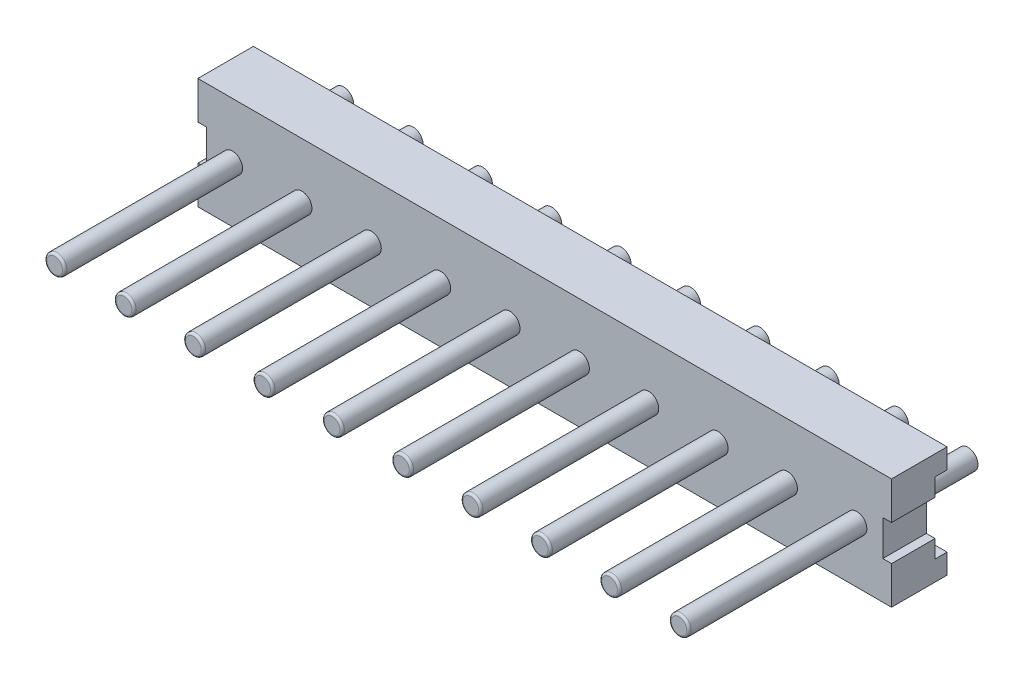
ISO-10303-21;
HEADER;
FILE_DESCRIPTION(('STEP AP214'),'2;1');
FILE_NAME('part.step','',(''),(''),'','','');
FILE_SCHEMA(('AUTOMOTIVE_DESIGN { 1 0 10303 214 1 1 1 1 }'));
ENDSEC;
DATA;
#1=APPLICATION_CONTEXT('core data for automotive mechanical design processes');
#2=APPLICATION_PROTOCOL_DEFINITION('international standard','automotive_design',2000,#1);
#3=PRODUCT_CONTEXT('',#1,'mechanical');
#4=PRODUCT('Part','Part','',(#3));
#5=PRODUCT_RELATED_PRODUCT_CATEGORY('part','',(#4));
#6=PRODUCT_DEFINITION_FORMATION('','',#4);
#7=PRODUCT_DEFINITION_CONTEXT('part definition',#1,'design');
#8=PRODUCT_DEFINITION('design','',#6,#7);
#9=PRODUCT_DEFINITION_SHAPE('','',#8);
#10=(LENGTH_UNIT() NAMED_UNIT(*) SI_UNIT(.MILLI.,.METRE.));
#11=(NAMED_UNIT(*) PLANE_ANGLE_UNIT() SI_UNIT($,.RADIAN.));
#12=(NAMED_UNIT(*) SI_UNIT($,.STERADIAN.) SOLID_ANGLE_UNIT());
#13=UNCERTAINTY_MEASURE_WITH_UNIT(LENGTH_MEASURE(1.E-05),#10,'distance_accuracy_value','');
#14=(GEOMETRIC_REPRESENTATION_CONTEXT(3) GLOBAL_UNCERTAINTY_ASSIGNED_CONTEXT((#13)) GLOBAL_UNIT_ASSIGNED_CONTEXT((#10,
#11,#12)) REPRESENTATION_CONTEXT('',''));
#15=CARTESIAN_POINT('',(0.,0.,0.));
#16=DIRECTION('',(0.,0.,1.));
#17=DIRECTION('',(1.,0.,0.));
#18=AXIS2_PLACEMENT_3D('',#15,#16,#17);
#19=CARTESIAN_POINT('',(17.20722824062,-0.6235717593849,-6.35));
#20=DIRECTION('',(0.,0.,1.));
#21=DIRECTION('',(1.,0.,0.));
#22=AXIS2_PLACEMENT_3D('',#19,#20,#21);
#23=PLANE('',#22);
#24=CARTESIAN_POINT('',(17.8308,0.,-6.35));
#25=DIRECTION('',(0.,0.,1.));
#26=DIRECTION('',(1.,0.,0.));
#27=AXIS2_PLACEMENT_3D('',#24,#25,#26);
#28=CIRCLE('',#27,0.571499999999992);
#29=CARTESIAN_POINT('',(18.4023,0.,-6.35));
#30=VERTEX_POINT('',#29);
#31=EDGE_CURVE('E181',#30,#30,#28,.F.);
#32=ORIENTED_EDGE('',*,*,#31,.T.);
#33=EDGE_LOOP('',(#32));
#34=FACE_BOUND('',#33,.T.);
#35=ADVANCED_FACE('F33',(#34),#23,.F.);
#36=CARTESIAN_POINT('',(13.24482824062,-0.6235717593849,-6.35));
#37=DIRECTION('',(0.,0.,1.));
#38=DIRECTION('',(1.,0.,0.));
#39=AXIS2_PLACEMENT_3D('',#36,#37,#38);
#40=PLANE('',#39);
#41=CARTESIAN_POINT('',(13.8684,0.,-6.35));
#42=DIRECTION('',(0.,0.,1.));
#43=DIRECTION('',(1.,0.,0.));
#44=AXIS2_PLACEMENT_3D('',#41,#42,#43);
#45=CIRCLE('',#44,0.571499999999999);
#46=CARTESIAN_POINT('',(14.4399,0.,-6.35));
#47=VERTEX_POINT('',#46);
#48=EDGE_CURVE('E266',#47,#47,#45,.F.);
#49=ORIENTED_EDGE('',*,*,#48,.T.);
#50=EDGE_LOOP('',(#49));
#51=FACE_BOUND('',#50,.T.);
#52=ADVANCED_FACE('F1107',(#51),#40,.F.);
#53=CARTESIAN_POINT('',(9.282428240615,-0.6235717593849,-6.35));
#54=DIRECTION('',(0.,0.,1.));
#55=DIRECTION('',(1.,0.,0.));
#56=AXIS2_PLACEMENT_3D('',#53,#54,#55);
#57=PLANE('',#56);
#58=CARTESIAN_POINT('',(9.906,0.,-6.35));
#59=DIRECTION('',(0.,0.,1.));
#60=DIRECTION('',(1.,0.,0.));
#61=AXIS2_PLACEMENT_3D('',#58,#59,#60);
#62=CIRCLE('',#61,0.571499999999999);
#63=CARTESIAN_POINT('',(10.4775,0.,-6.35));
#64=VERTEX_POINT('',#63);
#65=EDGE_CURVE('E263',#64,#64,#62,.F.);
#66=ORIENTED_EDGE('',*,*,#65,.T.);
#67=EDGE_LOOP('',(#66));
#68=FACE_BOUND('',#67,.T.);
#69=ADVANCED_FACE('F1098',(#68),#57,.F.);
#70=CARTESIAN_POINT('',(5.320028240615,-0.6235717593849,-6.35));
#71=DIRECTION('',(0.,0.,1.));
#72=DIRECTION('',(1.,0.,0.));
#73=AXIS2_PLACEMENT_3D('',#70,#71,#72);
#74=PLANE('',#73);
#75=CARTESIAN_POINT('',(5.9436,0.,-6.35));
#76=DIRECTION('',(0.,0.,1.));
#77=DIRECTION('',(1.,0.,0.));
#78=AXIS2_PLACEMENT_3D('',#75,#76,#77);
#79=CIRCLE('',#78,0.571499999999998);
#80=CARTESIAN_POINT('',(6.5151,0.,-6.35));
#81=VERTEX_POINT('',#80);
#82=EDGE_CURVE('E260',#81,#81,#79,.F.);
#83=ORIENTED_EDGE('',*,*,#82,.T.);
#84=EDGE_LOOP('',(#83));
#85=FACE_BOUND('',#84,.T.);
#86=ADVANCED_FACE('F1089',(#85),#74,.F.);
#87=CARTESIAN_POINT('',(1.357628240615,-0.6235717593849,-6.35));
#88=DIRECTION('',(0.,0.,1.));
#89=DIRECTION('',(1.,0.,0.));
#90=AXIS2_PLACEMENT_3D('',#87,#88,#89);
#91=PLANE('',#90);
#92=CARTESIAN_POINT('',(1.9812,0.,-6.35));
#93=DIRECTION('',(0.,0.,1.));
#94=DIRECTION('',(1.,0.,0.));
#95=AXIS2_PLACEMENT_3D('',#92,#93,#94);
#96=CIRCLE('',#95,0.5715);
#97=CARTESIAN_POINT('',(2.5527,0.,-6.35));
#98=VERTEX_POINT('',#97);
#99=EDGE_CURVE('E257',#98,#98,#96,.F.);
#100=ORIENTED_EDGE('',*,*,#99,.T.);
#101=EDGE_LOOP('',(#100));
#102=FACE_BOUND('',#101,.T.);
#103=ADVANCED_FACE('F1080',(#102),#91,.F.);
#104=CARTESIAN_POINT('',(-2.604771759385,-0.6235717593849,-6.35));
#105=DIRECTION('',(0.,0.,1.));
#106=DIRECTION('',(1.,0.,0.));
#107=AXIS2_PLACEMENT_3D('',#104,#105,#106);
#108=PLANE('',#107);
#109=CARTESIAN_POINT('',(-1.9812,0.,-6.35));
#110=DIRECTION('',(0.,0.,1.));
#111=DIRECTION('',(1.,0.,0.));
#112=AXIS2_PLACEMENT_3D('',#109,#110,#111);
#113=CIRCLE('',#112,0.5715);
#114=CARTESIAN_POINT('',(-1.4097,0.,-6.35));
#115=VERTEX_POINT('',#114);
#116=EDGE_CURVE('E254',#115,#115,#113,.F.);
#117=ORIENTED_EDGE('',*,*,#116,.T.);
#118=EDGE_LOOP('',(#117));
#119=FACE_BOUND('',#118,.T.);
#120=ADVANCED_FACE('F1071',(#119),#108,.F.);
#121=CARTESIAN_POINT('',(-6.567171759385,-0.6235717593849,-6.35));
#122=DIRECTION('',(0.,0.,1.));
#123=DIRECTION('',(1.,0.,0.));
#124=AXIS2_PLACEMENT_3D('',#121,#122,#123);
#125=PLANE('',#124);
#126=CARTESIAN_POINT('',(-5.9436,0.,-6.35));
#127=DIRECTION('',(0.,0.,1.));
#128=DIRECTION('',(1.,0.,0.));
#129=AXIS2_PLACEMENT_3D('',#126,#127,#128);
#130=CIRCLE('',#129,0.571500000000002);
#131=CARTESIAN_POINT('',(-5.3721,0.,-6.35));
#132=VERTEX_POINT('',#131);
#133=EDGE_CURVE('E251',#132,#132,#130,.F.);
#134=ORIENTED_EDGE('',*,*,#133,.T.);
#135=EDGE_LOOP('',(#134));
#136=FACE_BOUND('',#135,.T.);
#137=ADVANCED_FACE('F1062',(#136),#125,.F.);
#138=CARTESIAN_POINT('',(-10.52957175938,-0.6235717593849,-6.35));
#139=DIRECTION('',(0.,0.,1.));
#140=DIRECTION('',(1.,0.,0.));
#141=AXIS2_PLACEMENT_3D('',#138,#139,#140);
#142=PLANE('',#141);
#143=CARTESIAN_POINT('',(-9.906,0.,-6.35));
#144=DIRECTION('',(0.,0.,1.));
#145=DIRECTION('',(1.,0.,0.));
#146=AXIS2_PLACEMENT_3D('',#143,#144,#145);
#147=CIRCLE('',#146,0.571500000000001);
#148=CARTESIAN_POINT('',(-9.3345,0.,-6.35));
#149=VERTEX_POINT('',#148);
#150=EDGE_CURVE('E248',#149,#149,#147,.F.);
#151=ORIENTED_EDGE('',*,*,#150,.T.);
#152=EDGE_LOOP('',(#151));
#153=FACE_BOUND('',#152,.T.);
#154=ADVANCED_FACE('F1053',(#153),#142,.F.);
#155=CARTESIAN_POINT('',(-14.49197175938,-0.6235717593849,-6.35));
#156=DIRECTION('',(0.,0.,1.));
#157=DIRECTION('',(1.,0.,0.));
#158=AXIS2_PLACEMENT_3D('',#155,#156,#157);
#159=PLANE('',#158);
#160=CARTESIAN_POINT('',(-13.8684,0.,-6.35));
#161=DIRECTION('',(0.,0.,1.));
#162=DIRECTION('',(1.,0.,0.));
#163=AXIS2_PLACEMENT_3D('',#160,#161,#162);
#164=CIRCLE('',#163,0.571500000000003);
#165=CARTESIAN_POINT('',(-13.2969,0.,-6.35));
#166=VERTEX_POINT('',#165);
#167=EDGE_CURVE('E177',#166,#166,#164,.F.);
#168=ORIENTED_EDGE('',*,*,#167,.T.);
#169=EDGE_LOOP('',(#168));
#170=FACE_BOUND('',#169,.T.);
#171=ADVANCED_FACE('F1044',(#170),#159,.F.);
#172=CARTESIAN_POINT('',(-18.45437175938,-0.6235717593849,-6.35));
#173=DIRECTION('',(0.,0.,1.));
#174=DIRECTION('',(1.,0.,0.));
#175=AXIS2_PLACEMENT_3D('',#172,#173,#174);
#176=PLANE('',#175);
#177=CARTESIAN_POINT('',(-17.8308,0.,-6.35));
#178=DIRECTION('',(0.,0.,1.));
#179=DIRECTION('',(1.,0.,0.));
#180=AXIS2_PLACEMENT_3D('',#177,#178,#179);
#181=CIRCLE('',#180,0.571500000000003);
#182=CARTESIAN_POINT('',(-17.2593,0.,-6.35));
#183=VERTEX_POINT('',#182);
#184=EDGE_CURVE('E174',#183,#183,#181,.F.);
#185=ORIENTED_EDGE('',*,*,#184,.T.);
#186=EDGE_LOOP('',(#185));
#187=FACE_BOUND('',#186,.T.);
#188=ADVANCED_FACE('F1037',(#187),#176,.F.);
#189=CARTESIAN_POINT('',(-20.60448,2.032,-2.437128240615));
#190=DIRECTION('',(0.,-1.,0.));
#191=DIRECTION('',(0.,0.,-1.));
#192=AXIS2_PLACEMENT_3D('',#189,#190,#191);
#193=PLANE('',#192);
#194=DIRECTION('',(0.,0.,1.));
#195=VECTOR('',#194,1.);
#196=CARTESIAN_POINT('',(19.812,2.032,-2.8321));
#197=LINE('',#196,#195);
#198=CARTESIAN_POINT('',(19.812,2.03199999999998,-3.17500000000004));
#199=VERTEX_POINT('',#198);
#200=CARTESIAN_POINT('',(19.812,2.032,-2.48919999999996));
#201=VERTEX_POINT('',#200);
#202=EDGE_CURVE('E159',#199,#201,#197,.T.);
#203=ORIENTED_EDGE('',*,*,#202,.T.);
#204=DIRECTION('',(1.,0.,0.));
#205=VECTOR('',#204,1.);
#206=CARTESIAN_POINT('',(0.,2.032,-2.4892));
#207=LINE('',#206,#205);
#208=CARTESIAN_POINT('',(-19.812,2.032,-2.48919999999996));
#209=VERTEX_POINT('',#208);
#210=EDGE_CURVE('E154',#209,#201,#207,.T.);
#211=ORIENTED_EDGE('',*,*,#210,.F.);
#212=DIRECTION('',(0.,0.,-1.));
#213=VECTOR('',#212,1.);
#214=CARTESIAN_POINT('',(-19.812,2.032,-2.8321));
#215=LINE('',#214,#213);
#216=CARTESIAN_POINT('',(-19.812,2.03199999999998,-3.17500000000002));
#217=VERTEX_POINT('',#216);
#218=EDGE_CURVE('E148',#209,#217,#215,.T.);
#219=ORIENTED_EDGE('',*,*,#218,.T.);
#220=DIRECTION('',(-1.,0.,0.));
#221=VECTOR('',#220,1.);
#222=CARTESIAN_POINT('',(0.,2.03199999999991,-3.175));
#223=LINE('',#222,#221);
#224=EDGE_CURVE('E151',#199,#217,#223,.T.);
#225=ORIENTED_EDGE('',*,*,#224,.F.);
#226=EDGE_LOOP('',(#203,#211,#219,#225));
#227=FACE_BOUND('',#226,.T.);
#228=ADVANCED_FACE('F150',(#227),#193,.T.);
#229=CARTESIAN_POINT('',(17.8308,0.,-6.35));
#230=DIRECTION('',(0.,0.,1.));
#231=DIRECTION('',(1.,0.,0.));
#232=AXIS2_PLACEMENT_3D('',#229,#230,#231);
#233=CYLINDRICAL_SURFACE('',#232,0.571499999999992);
#234=ORIENTED_EDGE('',*,*,#31,.F.);
#235=EDGE_LOOP('',(#234));
#236=FACE_BOUND('',#235,.T.);
#237=CARTESIAN_POINT('',(17.8308,0.,-2.48920000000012));
#238=DIRECTION('',(0.,0.,1.));
#239=DIRECTION('',(1.,0.,0.));
#240=AXIS2_PLACEMENT_3D('',#237,#238,#239);
#241=CIRCLE('',#240,0.571499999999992);
#242=CARTESIAN_POINT('',(18.4023,0.,-2.48920000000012));
#243=VERTEX_POINT('',#242);
#244=EDGE_CURVE('E243',#243,#243,#241,.T.);
#245=ORIENTED_EDGE('',*,*,#244,.F.);
#246=EDGE_LOOP('',(#245));
#247=FACE_BOUND('',#246,.T.);
#248=ADVANCED_FACE('F881',(#236,#247),#233,.T.);
#249=CARTESIAN_POINT('',(13.8684,0.,-6.35));
#250=DIRECTION('',(0.,0.,1.));
#251=DIRECTION('',(1.,0.,0.));
#252=AXIS2_PLACEMENT_3D('',#249,#250,#251);
#253=CYLINDRICAL_SURFACE('',#252,0.571499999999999);
#254=ORIENTED_EDGE('',*,*,#48,.F.);
#255=EDGE_LOOP('',(#254));
#256=FACE_BOUND('',#255,.T.);
#257=CARTESIAN_POINT('',(13.8684,0.,-2.48920000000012));
#258=DIRECTION('',(0.,0.,1.));
#259=DIRECTION('',(1.,0.,0.));
#260=AXIS2_PLACEMENT_3D('',#257,#258,#259);
#261=CIRCLE('',#260,0.571499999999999);
#262=CARTESIAN_POINT('',(14.4399,0.,-2.48920000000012));
#263=VERTEX_POINT('',#262);
#264=EDGE_CURVE('E240',#263,#263,#261,.T.);
#265=ORIENTED_EDGE('',*,*,#264,.F.);
#266=EDGE_LOOP('',(#265));
#267=FACE_BOUND('',#266,.T.);
#268=ADVANCED_FACE('F885',(#256,#267),#253,.T.);
#269=CARTESIAN_POINT('',(9.906,0.,-6.35));
#270=DIRECTION('',(0.,0.,1.));
#271=DIRECTION('',(1.,0.,0.));
#272=AXIS2_PLACEMENT_3D('',#269,#270,#271);
#273=CYLINDRICAL_SURFACE('',#272,0.571499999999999);
#274=ORIENTED_EDGE('',*,*,#65,.F.);
#275=EDGE_LOOP('',(#274));
#276=FACE_BOUND('',#275,.T.);
#277=CARTESIAN_POINT('',(9.906,0.,-2.48920000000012));
#278=DIRECTION('',(0.,0.,1.));
#279=DIRECTION('',(1.,0.,0.));
#280=AXIS2_PLACEMENT_3D('',#277,#278,#279);
#281=CIRCLE('',#280,0.571499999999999);
#282=CARTESIAN_POINT('',(10.4775,0.,-2.48920000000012));
#283=VERTEX_POINT('',#282);
#284=EDGE_CURVE('E237',#283,#283,#281,.T.);
#285=ORIENTED_EDGE('',*,*,#284,.F.);
#286=EDGE_LOOP('',(#285));
#287=FACE_BOUND('',#286,.T.);
#288=ADVANCED_FACE('F898',(#276,#287),#273,.T.);
#289=CARTESIAN_POINT('',(5.9436,0.,-6.35));
#290=DIRECTION('',(0.,0.,1.));
#291=DIRECTION('',(1.,0.,0.));
#292=AXIS2_PLACEMENT_3D('',#289,#290,#291);
#293=CYLINDRICAL_SURFACE('',#292,0.571499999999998);
#294=ORIENTED_EDGE('',*,*,#82,.F.);
#295=EDGE_LOOP('',(#294));
#296=FACE_BOUND('',#295,.T.);
#297=CARTESIAN_POINT('',(5.9436,0.,-2.48920000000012));
#298=DIRECTION('',(0.,0.,1.));
#299=DIRECTION('',(1.,0.,0.));
#300=AXIS2_PLACEMENT_3D('',#297,#298,#299);
#301=CIRCLE('',#300,0.571499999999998);
#302=CARTESIAN_POINT('',(6.5151,0.,-2.48920000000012));
#303=VERTEX_POINT('',#302);
#304=EDGE_CURVE('E234',#303,#303,#301,.T.);
#305=ORIENTED_EDGE('',*,*,#304,.F.);
#306=EDGE_LOOP('',(#305));
#307=FACE_BOUND('',#306,.T.);
#308=ADVANCED_FACE('F908',(#296,#307),#293,.T.);
#309=CARTESIAN_POINT('',(1.9812,0.,-6.35));
#310=DIRECTION('',(0.,0.,1.));
#311=DIRECTION('',(1.,0.,0.));
#312=AXIS2_PLACEMENT_3D('',#309,#310,#311);
#313=CYLINDRICAL_SURFACE('',#312,0.5715);
#314=ORIENTED_EDGE('',*,*,#99,.F.);
#315=EDGE_LOOP('',(#314));
#316=FACE_BOUND('',#315,.T.);
#317=CARTESIAN_POINT('',(1.9812,0.,-2.48920000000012));
#318=DIRECTION('',(0.,0.,1.));
#319=DIRECTION('',(1.,0.,0.));
#320=AXIS2_PLACEMENT_3D('',#317,#318,#319);
#321=CIRCLE('',#320,0.5715);
#322=CARTESIAN_POINT('',(2.5527,0.,-2.48920000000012));
#323=VERTEX_POINT('',#322);
#324=EDGE_CURVE('E231',#323,#323,#321,.T.);
#325=ORIENTED_EDGE('',*,*,#324,.F.);
#326=EDGE_LOOP('',(#325));
#327=FACE_BOUND('',#326,.T.);
#328=ADVANCED_FACE('F917',(#316,#327),#313,.T.);
#329=CARTESIAN_POINT('',(-1.9812,0.,-6.35));
#330=DIRECTION('',(0.,0.,1.));
#331=DIRECTION('',(1.,0.,0.));
#332=AXIS2_PLACEMENT_3D('',#329,#330,#331);
#333=CYLINDRICAL_SURFACE('',#332,0.5715);
#334=ORIENTED_EDGE('',*,*,#116,.F.);
#335=EDGE_LOOP('',(#334));
#336=FACE_BOUND('',#335,.T.);
#337=CARTESIAN_POINT('',(-1.9812,0.,-2.48920000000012));
#338=DIRECTION('',(0.,0.,1.));
#339=DIRECTION('',(1.,0.,0.));
#340=AXIS2_PLACEMENT_3D('',#337,#338,#339);
#341=CIRCLE('',#340,0.5715);
#342=CARTESIAN_POINT('',(-1.4097,0.,-2.48920000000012));
#343=VERTEX_POINT('',#342);
#344=EDGE_CURVE('E228',#343,#343,#341,.T.);
#345=ORIENTED_EDGE('',*,*,#344,.F.);
#346=EDGE_LOOP('',(#345));
#347=FACE_BOUND('',#346,.T.);
#348=ADVANCED_FACE('F926',(#336,#347),#333,.T.);
#349=CARTESIAN_POINT('',(-5.9436,0.,-6.35));
#350=DIRECTION('',(0.,0.,1.));
#351=DIRECTION('',(1.,0.,0.));
#352=AXIS2_PLACEMENT_3D('',#349,#350,#351);
#353=CYLINDRICAL_SURFACE('',#352,0.571500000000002);
#354=ORIENTED_EDGE('',*,*,#133,.F.);
#355=EDGE_LOOP('',(#354));
#356=FACE_BOUND('',#355,.T.);
#357=CARTESIAN_POINT('',(-5.9436,0.,-2.48920000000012));
#358=DIRECTION('',(0.,0.,1.));
#359=DIRECTION('',(1.,0.,0.));
#360=AXIS2_PLACEMENT_3D('',#357,#358,#359);
#361=CIRCLE('',#360,0.571500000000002);
#362=CARTESIAN_POINT('',(-5.3721,0.,-2.48920000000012));
#363=VERTEX_POINT('',#362);
#364=EDGE_CURVE('E225',#363,#363,#361,.T.);
#365=ORIENTED_EDGE('',*,*,#364,.F.);
#366=EDGE_LOOP('',(#365));
#367=FACE_BOUND('',#366,.T.);
#368=ADVANCED_FACE('F935',(#356,#367),#353,.T.);
#369=CARTESIAN_POINT('',(-9.906,0.,-6.35));
#370=DIRECTION('',(0.,0.,1.));
#371=DIRECTION('',(1.,0.,0.));
#372=AXIS2_PLACEMENT_3D('',#369,#370,#371);
#373=CYLINDRICAL_SURFACE('',#372,0.571500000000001);
#374=ORIENTED_EDGE('',*,*,#150,.F.);
#375=EDGE_LOOP('',(#374));
#376=FACE_BOUND('',#375,.T.);
#377=CARTESIAN_POINT('',(-9.906,0.,-2.48920000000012));
#378=DIRECTION('',(0.,0.,1.));
#379=DIRECTION('',(1.,0.,0.));
#380=AXIS2_PLACEMENT_3D('',#377,#378,#379);
#381=CIRCLE('',#380,0.571500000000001);
#382=CARTESIAN_POINT('',(-9.3345,0.,-2.48920000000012));
#383=VERTEX_POINT('',#382);
#384=EDGE_CURVE('E222',#383,#383,#381,.T.);
#385=ORIENTED_EDGE('',*,*,#384,.F.);
#386=EDGE_LOOP('',(#385));
#387=FACE_BOUND('',#386,.T.);
#388=ADVANCED_FACE('F944',(#376,#387),#373,.T.);
#389=CARTESIAN_POINT('',(-13.8684,0.,-6.35));
#390=DIRECTION('',(0.,0.,1.));
#391=DIRECTION('',(1.,0.,0.));
#392=AXIS2_PLACEMENT_3D('',#389,#390,#391);
#393=CYLINDRICAL_SURFACE('',#392,0.571500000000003);
#394=ORIENTED_EDGE('',*,*,#167,.F.);
#395=EDGE_LOOP('',(#394));
#396=FACE_BOUND('',#395,.T.);
#397=CARTESIAN_POINT('',(-13.8684,0.,-2.48920000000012));
#398=DIRECTION('',(0.,0.,1.));
#399=DIRECTION('',(1.,0.,0.));
#400=AXIS2_PLACEMENT_3D('',#397,#398,#399);
#401=CIRCLE('',#400,0.571500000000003);
#402=CARTESIAN_POINT('',(-13.2969,0.,-2.48920000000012));
#403=VERTEX_POINT('',#402);
#404=EDGE_CURVE('E219',#403,#403,#401,.T.);
#405=ORIENTED_EDGE('',*,*,#404,.F.);
#406=EDGE_LOOP('',(#405));
#407=FACE_BOUND('',#406,.T.);
#408=ADVANCED_FACE('F953',(#396,#407),#393,.T.);
#409=CARTESIAN_POINT('',(-17.8308,0.,-6.35));
#410=DIRECTION('',(0.,0.,1.));
#411=DIRECTION('',(1.,0.,0.));
#412=AXIS2_PLACEMENT_3D('',#409,#410,#411);
#413=CYLINDRICAL_SURFACE('',#412,0.571500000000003);
#414=ORIENTED_EDGE('',*,*,#184,.F.);
#415=EDGE_LOOP('',(#414));
#416=FACE_BOUND('',#415,.T.);
#417=CARTESIAN_POINT('',(-17.8308,0.,-2.48920000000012));
#418=DIRECTION('',(0.,0.,1.));
#419=DIRECTION('',(1.,0.,0.));
#420=AXIS2_PLACEMENT_3D('',#417,#418,#419);
#421=CIRCLE('',#420,0.571500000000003);
#422=CARTESIAN_POINT('',(-17.2593,0.,-2.48920000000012));
#423=VERTEX_POINT('',#422);
#424=EDGE_CURVE('E215',#423,#423,#421,.T.);
#425=ORIENTED_EDGE('',*,*,#424,.F.);
#426=EDGE_LOOP('',(#425));
#427=FACE_BOUND('',#426,.T.);
#428=ADVANCED_FACE('F962',(#416,#427),#413,.T.);
#429=CARTESIAN_POINT('',(-20.60448,1.979928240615,-3.175));
#430=DIRECTION('',(0.,0.,-1.));
#431=DIRECTION('',(0.,1.,0.));
#432=AXIS2_PLACEMENT_3D('',#429,#430,#431);
#433=PLANE('',#432);
#434=DIRECTION('',(0.,1.,0.));
#435=VECTOR('',#434,1.);
#436=CARTESIAN_POINT('',(19.812,0.,-3.175));
#437=LINE('',#436,#435);
#438=CARTESIAN_POINT('',(19.812,3.175,-3.175));
#439=VERTEX_POINT('',#438);
#440=EDGE_CURVE('E166',#199,#439,#437,.T.);
#441=ORIENTED_EDGE('',*,*,#440,.F.);
#442=ORIENTED_EDGE('',*,*,#224,.T.);
#443=DIRECTION('',(0.,1.,0.));
#444=VECTOR('',#443,1.);
#445=CARTESIAN_POINT('',(-19.812,2.6035,-3.175));
#446=LINE('',#445,#444);
#447=CARTESIAN_POINT('',(-19.812,3.175,-3.175));
#448=VERTEX_POINT('',#447);
#449=EDGE_CURVE('E164',#217,#448,#446,.T.);
#450=ORIENTED_EDGE('',*,*,#449,.T.);
#451=DIRECTION('',(-1.,0.,0.));
#452=VECTOR('',#451,1.);
#453=CARTESIAN_POINT('',(0.,3.175,-3.175));
#454=LINE('',#453,#452);
#455=EDGE_CURVE('E553',#439,#448,#454,.T.);
#456=ORIENTED_EDGE('',*,*,#455,.F.);
#457=EDGE_LOOP('',(#441,#442,#450,#456));
#458=FACE_BOUND('',#457,.T.);
#459=ADVANCED_FACE('F162',(#458),#433,.T.);
#460=CARTESIAN_POINT('',(-19.25992824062,1.016,-2.541271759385));
#461=DIRECTION('',(0.,1.,0.));
#462=DIRECTION('',(-1.,0.,0.));
#463=AXIS2_PLACEMENT_3D('',#460,#461,#462);
#464=PLANE('',#463);
#465=DIRECTION('',(0.,0.,1.));
#466=VECTOR('',#465,1.);
#467=CARTESIAN_POINT('',(-19.312,1.016,-1.24460000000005));
#468=LINE('',#467,#466);
#469=CARTESIAN_POINT('',(-19.312000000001,1.016,-2.4892));
#470=VERTEX_POINT('',#469);
#471=CARTESIAN_POINT('',(-19.312000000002,1.016,0.));
#472=VERTEX_POINT('',#471);
#473=EDGE_CURVE('E541',#470,#472,#468,.T.);
#474=ORIENTED_EDGE('',*,*,#473,.T.);
#475=DIRECTION('',(1.,0.,0.));
#476=VECTOR('',#475,1.);
#477=CARTESIAN_POINT('',(-19.562,1.016,0.));
#478=LINE('',#477,#476);
#479=CARTESIAN_POINT('',(-19.811999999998,1.016,0.));
#480=VERTEX_POINT('',#479);
#481=EDGE_CURVE('E167',#480,#472,#478,.T.);
#482=ORIENTED_EDGE('',*,*,#481,.F.);
#483=DIRECTION('',(0.,0.,-1.));
#484=VECTOR('',#483,1.);
#485=CARTESIAN_POINT('',(-19.812,1.016,-1.5875));
#486=LINE('',#485,#484);
#487=CARTESIAN_POINT('',(-19.811999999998,1.016,-2.4892));
#488=VERTEX_POINT('',#487);
#489=EDGE_CURVE('E550',#480,#488,#486,.T.);
#490=ORIENTED_EDGE('',*,*,#489,.T.);
#491=DIRECTION('',(-1.,0.,0.));
#492=VECTOR('',#491,1.);
#493=CARTESIAN_POINT('',(0.,1.016,-2.4892));
#494=LINE('',#493,#492);
#495=EDGE_CURVE('E571',#470,#488,#494,.T.);
#496=ORIENTED_EDGE('',*,*,#495,.F.);
#497=EDGE_LOOP('',(#474,#482,#490,#496));
#498=FACE_BOUND('',#497,.T.);
#499=ADVANCED_FACE('F585',(#498),#464,.F.);
#500=CARTESIAN_POINT('',(19.86407175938,1.016,-2.541271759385));
#501=DIRECTION('',(0.,1.,0.));
#502=DIRECTION('',(-1.,0.,0.));
#503=AXIS2_PLACEMENT_3D('',#500,#501,#502);
#504=PLANE('',#503);
#505=DIRECTION('',(0.,0.,-1.));
#506=VECTOR('',#505,1.);
#507=CARTESIAN_POINT('',(19.312,1.01600000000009,-1.24460000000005));
#508=LINE('',#507,#506);
#509=CARTESIAN_POINT('',(19.312000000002,1.01600000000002,0.));
#510=VERTEX_POINT('',#509);
#511=CARTESIAN_POINT('',(19.312000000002,1.01600000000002,-2.4892));
#512=VERTEX_POINT('',#511);
#513=EDGE_CURVE('E510',#510,#512,#508,.T.);
#514=ORIENTED_EDGE('',*,*,#513,.T.);
#515=DIRECTION('',(-1.,0.,0.));
#516=VECTOR('',#515,1.);
#517=CARTESIAN_POINT('',(0.,1.016,-2.4892));
#518=LINE('',#517,#516);
#519=CARTESIAN_POINT('',(19.811999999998,1.016,-2.4892));
#520=VERTEX_POINT('',#519);
#521=EDGE_CURVE('E578',#520,#512,#518,.T.);
#522=ORIENTED_EDGE('',*,*,#521,.F.);
#523=DIRECTION('',(0.,0.,-1.));
#524=VECTOR('',#523,1.);
#525=CARTESIAN_POINT('',(19.812,1.016,-1.5875));
#526=LINE('',#525,#524);
#527=CARTESIAN_POINT('',(19.811999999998,1.016,0.));
#528=VERTEX_POINT('',#527);
#529=EDGE_CURVE('E562',#528,#520,#526,.T.);
#530=ORIENTED_EDGE('',*,*,#529,.F.);
#531=DIRECTION('',(1.,0.,0.));
#532=VECTOR('',#531,1.);
#533=CARTESIAN_POINT('',(19.562,1.016,0.));
#534=LINE('',#533,#532);
#535=EDGE_CURVE('E580',#510,#528,#534,.T.);
#536=ORIENTED_EDGE('',*,*,#535,.F.);
#537=EDGE_LOOP('',(#514,#522,#530,#536));
#538=FACE_BOUND('',#537,.T.);
#539=ADVANCED_FACE('F610',(#538),#504,.F.);
#540=CARTESIAN_POINT('',(-20.60448,-2.11328,-2.4892));
#541=DIRECTION('',(0.,0.,-1.));
#542=DIRECTION('',(0.,1.,0.));
#543=AXIS2_PLACEMENT_3D('',#540,#541,#542);
#544=PLANE('',#543);
#545=ORIENTED_EDGE('',*,*,#424,.T.);
#546=EDGE_LOOP('',(#545));
#547=FACE_BOUND('',#546,.T.);
#548=ORIENTED_EDGE('',*,*,#404,.T.);
#549=EDGE_LOOP('',(#548));
#550=FACE_BOUND('',#549,.T.);
#551=ORIENTED_EDGE('',*,*,#384,.T.);
#552=EDGE_LOOP('',(#551));
#553=FACE_BOUND('',#552,.T.);
#554=ORIENTED_EDGE('',*,*,#364,.T.);
#555=EDGE_LOOP('',(#554));
#556=FACE_BOUND('',#555,.T.);
#557=ORIENTED_EDGE('',*,*,#344,.T.);
#558=EDGE_LOOP('',(#557));
#559=FACE_BOUND('',#558,.T.);
#560=ORIENTED_EDGE('',*,*,#324,.T.);
#561=EDGE_LOOP('',(#560));
#562=FACE_BOUND('',#561,.T.);
#563=ORIENTED_EDGE('',*,*,#304,.T.);
#564=EDGE_LOOP('',(#563));
#565=FACE_BOUND('',#564,.T.);
#566=ORIENTED_EDGE('',*,*,#284,.T.);
#567=EDGE_LOOP('',(#566));
#568=FACE_BOUND('',#567,.T.);
#569=ORIENTED_EDGE('',*,*,#264,.T.);
#570=EDGE_LOOP('',(#569));
#571=FACE_BOUND('',#570,.T.);
#572=ORIENTED_EDGE('',*,*,#244,.T.);
#573=EDGE_LOOP('',(#572));
#574=FACE_BOUND('',#573,.T.);
#575=ORIENTED_EDGE('',*,*,#210,.T.);
#576=DIRECTION('',(0.,1.,0.));
#577=VECTOR('',#576,1.);
#578=CARTESIAN_POINT('',(19.812,0.,-2.4892));
#579=LINE('',#578,#577);
#580=EDGE_CURVE('E559',#520,#201,#579,.T.);
#581=ORIENTED_EDGE('',*,*,#580,.F.);
#582=ORIENTED_EDGE('',*,*,#521,.T.);
#583=DIRECTION('',(0.,-1.,0.));
#584=VECTOR('',#583,1.);
#585=CARTESIAN_POINT('',(19.312,0.,-2.4892));
#586=LINE('',#585,#584);
#587=CARTESIAN_POINT('',(19.312000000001,-1.016,-2.4892));
#588=VERTEX_POINT('',#587);
#589=EDGE_CURVE('E506',#512,#588,#586,.T.);
#590=ORIENTED_EDGE('',*,*,#589,.T.);
#591=DIRECTION('',(1.,0.,0.));
#592=VECTOR('',#591,1.);
#593=CARTESIAN_POINT('',(19.562,-1.016,-2.4892));
#594=LINE('',#593,#592);
#595=CARTESIAN_POINT('',(19.811999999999,-1.016,-2.4892));
#596=VERTEX_POINT('',#595);
#597=EDGE_CURVE('E498',#588,#596,#594,.T.);
#598=ORIENTED_EDGE('',*,*,#597,.T.);
#599=DIRECTION('',(0.,-1.,0.));
#600=VECTOR('',#599,1.);
#601=CARTESIAN_POINT('',(19.812,0.,-2.4892));
#602=LINE('',#601,#600);
#603=CARTESIAN_POINT('',(19.812,-2.032,-2.48919999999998));
#604=VERTEX_POINT('',#603);
#605=EDGE_CURVE('E576',#596,#604,#602,.T.);
#606=ORIENTED_EDGE('',*,*,#605,.T.);
#607=DIRECTION('',(1.,0.,0.));
#608=VECTOR('',#607,1.);
#609=CARTESIAN_POINT('',(0.,-2.032,-2.48919999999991));
#610=LINE('',#609,#608);
#611=CARTESIAN_POINT('',(-19.812,-2.032,-2.48919999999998));
#612=VERTEX_POINT('',#611);
#613=EDGE_CURVE('E566',#612,#604,#610,.T.);
#614=ORIENTED_EDGE('',*,*,#613,.F.);
#615=DIRECTION('',(0.,1.,0.));
#616=VECTOR('',#615,1.);
#617=CARTESIAN_POINT('',(-19.812,0.,-2.4892));
#618=LINE('',#617,#616);
#619=CARTESIAN_POINT('',(-19.811999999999,-1.016,-2.4892));
#620=VERTEX_POINT('',#619);
#621=EDGE_CURVE('E142',#612,#620,#618,.T.);
#622=ORIENTED_EDGE('',*,*,#621,.T.);
#623=DIRECTION('',(1.,0.,0.));
#624=VECTOR('',#623,1.);
#625=CARTESIAN_POINT('',(0.,-1.016,-2.4892));
#626=LINE('',#625,#624);
#627=CARTESIAN_POINT('',(-19.312000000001,-1.01600000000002,-2.4892));
#628=VERTEX_POINT('',#627);
#629=EDGE_CURVE('E573',#620,#628,#626,.T.);
#630=ORIENTED_EDGE('',*,*,#629,.T.);
#631=DIRECTION('',(0.,1.,0.));
#632=VECTOR('',#631,1.);
#633=CARTESIAN_POINT('',(-19.312,0.,-2.4892));
#634=LINE('',#633,#632);
#635=EDGE_CURVE('E544',#628,#470,#634,.T.);
#636=ORIENTED_EDGE('',*,*,#635,.T.);
#637=ORIENTED_EDGE('',*,*,#495,.T.);
#638=DIRECTION('',(0.,1.,0.));
#639=VECTOR('',#638,1.);
#640=CARTESIAN_POINT('',(-19.812,0.,-2.4892));
#641=LINE('',#640,#639);
#642=EDGE_CURVE('E548',#488,#209,#641,.T.);
#643=ORIENTED_EDGE('',*,*,#642,.T.);
#644=EDGE_LOOP('',(#575,#581,#582,#590,#598,#606,#614,#622,#630,#636,#637,#643));
#645=FACE_BOUND('',#644,.T.);
#646=ADVANCED_FACE('F606',(#547,#550,#553,#556,#559,#562,#565,#568,#571,#574,#645),#544,.T.);
#647=CARTESIAN_POINT('',(17.20722824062,-0.6235717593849,10.16));
#648=DIRECTION('',(0.,0.,1.));
#649=DIRECTION('',(1.,0.,0.));
#650=AXIS2_PLACEMENT_3D('',#647,#648,#649);
#651=PLANE('',#650);
#652=CARTESIAN_POINT('',(17.8308,0.,10.16));
#653=DIRECTION('',(0.,0.,1.));
#654=DIRECTION('',(1.,0.,0.));
#655=AXIS2_PLACEMENT_3D('',#652,#653,#654);
#656=CIRCLE('',#655,0.444499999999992);
#657=CARTESIAN_POINT('',(18.2753,0.,10.16));
#658=VERTEX_POINT('',#657);
#659=EDGE_CURVE('E271',#658,#658,#656,.T.);
#660=ORIENTED_EDGE('',*,*,#659,.T.);
#661=EDGE_LOOP('',(#660));
#662=FACE_BOUND('',#661,.T.);
#663=ADVANCED_FACE('F399',(#662),#651,.T.);
#664=CARTESIAN_POINT('',(13.24482824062,-0.6235717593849,10.16));
#665=DIRECTION('',(0.,0.,1.));
#666=DIRECTION('',(1.,0.,0.));
#667=AXIS2_PLACEMENT_3D('',#664,#665,#666);
#668=PLANE('',#667);
#669=CARTESIAN_POINT('',(13.8684,0.,10.16));
#670=DIRECTION('',(0.,0.,1.));
#671=DIRECTION('',(1.,0.,0.));
#672=AXIS2_PLACEMENT_3D('',#669,#670,#671);
#673=CIRCLE('',#672,0.444499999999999);
#674=CARTESIAN_POINT('',(14.3129,0.,10.16));
#675=VERTEX_POINT('',#674);
#676=EDGE_CURVE('E278',#675,#675,#673,.T.);
#677=ORIENTED_EDGE('',*,*,#676,.T.);
#678=EDGE_LOOP('',(#677));
#679=FACE_BOUND('',#678,.T.);
#680=ADVANCED_FACE('F390',(#679),#668,.T.);
#681=CARTESIAN_POINT('',(9.282428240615,-0.6235717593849,10.16));
#682=DIRECTION('',(0.,0.,1.));
#683=DIRECTION('',(1.,0.,0.));
#684=AXIS2_PLACEMENT_3D('',#681,#682,#683);
#685=PLANE('',#684);
#686=CARTESIAN_POINT('',(9.906,0.,10.16));
#687=DIRECTION('',(0.,0.,1.));
#688=DIRECTION('',(1.,0.,0.));
#689=AXIS2_PLACEMENT_3D('',#686,#687,#688);
#690=CIRCLE('',#689,0.444499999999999);
#691=CARTESIAN_POINT('',(10.3505,0.,10.16));
#692=VERTEX_POINT('',#691);
#693=EDGE_CURVE('E314',#692,#692,#690,.T.);
#694=ORIENTED_EDGE('',*,*,#693,.T.);
#695=EDGE_LOOP('',(#694));
#696=FACE_BOUND('',#695,.T.);
#697=ADVANCED_FACE('F387',(#696),#685,.T.);
#698=CARTESIAN_POINT('',(5.320028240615,-0.6235717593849,10.16));
#699=DIRECTION('',(0.,0.,1.));
#700=DIRECTION('',(1.,0.,0.));
#701=AXIS2_PLACEMENT_3D('',#698,#699,#700);
#702=PLANE('',#701);
#703=CARTESIAN_POINT('',(5.9436,0.,10.16));
#704=DIRECTION('',(0.,0.,1.));
#705=DIRECTION('',(1.,0.,0.));
#706=AXIS2_PLACEMENT_3D('',#703,#704,#705);
#707=CIRCLE('',#706,0.444499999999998);
#708=CARTESIAN_POINT('',(6.3881,0.,10.16));
#709=VERTEX_POINT('',#708);
#710=EDGE_CURVE('E284',#709,#709,#707,.T.);
#711=ORIENTED_EDGE('',*,*,#710,.T.);
#712=EDGE_LOOP('',(#711));
#713=FACE_BOUND('',#712,.T.);
#714=ADVANCED_FACE('F389',(#713),#702,.T.);
#715=CARTESIAN_POINT('',(1.357628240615,-0.6235717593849,10.16));
#716=DIRECTION('',(0.,0.,1.));
#717=DIRECTION('',(1.,0.,0.));
#718=AXIS2_PLACEMENT_3D('',#715,#716,#717);
#719=PLANE('',#718);
#720=CARTESIAN_POINT('',(1.9812,0.,10.16));
#721=DIRECTION('',(0.,0.,1.));
#722=DIRECTION('',(1.,0.,0.));
#723=AXIS2_PLACEMENT_3D('',#720,#721,#722);
#724=CIRCLE('',#723,0.4445);
#725=CARTESIAN_POINT('',(2.4257,0.,10.16));
#726=VERTEX_POINT('',#725);
#727=EDGE_CURVE('E290',#726,#726,#724,.T.);
#728=ORIENTED_EDGE('',*,*,#727,.T.);
#729=EDGE_LOOP('',(#728));
#730=FACE_BOUND('',#729,.T.);
#731=ADVANCED_FACE('F396',(#730),#719,.T.);
#732=CARTESIAN_POINT('',(-2.604771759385,-0.6235717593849,10.16));
#733=DIRECTION('',(0.,0.,1.));
#734=DIRECTION('',(1.,0.,0.));
#735=AXIS2_PLACEMENT_3D('',#732,#733,#734);
#736=PLANE('',#735);
#737=CARTESIAN_POINT('',(-1.9812,0.,10.16));
#738=DIRECTION('',(0.,0.,1.));
#739=DIRECTION('',(1.,0.,0.));
#740=AXIS2_PLACEMENT_3D('',#737,#738,#739);
#741=CIRCLE('',#740,0.4445);
#742=CARTESIAN_POINT('',(-1.5367,0.,10.16));
#743=VERTEX_POINT('',#742);
#744=EDGE_CURVE('E296',#743,#743,#741,.T.);
#745=ORIENTED_EDGE('',*,*,#744,.T.);
#746=EDGE_LOOP('',(#745));
#747=FACE_BOUND('',#746,.T.);
#748=ADVANCED_FACE('F406',(#747),#736,.T.);
#749=CARTESIAN_POINT('',(-6.567171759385,-0.6235717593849,10.16));
#750=DIRECTION('',(0.,0.,1.));
#751=DIRECTION('',(1.,0.,0.));
#752=AXIS2_PLACEMENT_3D('',#749,#750,#751);
#753=PLANE('',#752);
#754=CARTESIAN_POINT('',(-5.9436,0.,10.16));
#755=DIRECTION('',(0.,0.,1.));
#756=DIRECTION('',(1.,0.,0.));
#757=AXIS2_PLACEMENT_3D('',#754,#755,#756);
#758=CIRCLE('',#757,0.444500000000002);
#759=CARTESIAN_POINT('',(-5.4991,0.,10.16));
#760=VERTEX_POINT('',#759);
#761=EDGE_CURVE('E302',#760,#760,#758,.T.);
#762=ORIENTED_EDGE('',*,*,#761,.T.);
#763=EDGE_LOOP('',(#762));
#764=FACE_BOUND('',#763,.T.);
#765=ADVANCED_FACE('F410',(#764),#753,.T.);
#766=CARTESIAN_POINT('',(-10.52957175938,-0.6235717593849,10.16));
#767=DIRECTION('',(0.,0.,1.));
#768=DIRECTION('',(1.,0.,0.));
#769=AXIS2_PLACEMENT_3D('',#766,#767,#768);
#770=PLANE('',#769);
#771=CARTESIAN_POINT('',(-9.906,0.,10.16));
#772=DIRECTION('',(0.,0.,1.));
#773=DIRECTION('',(1.,0.,0.));
#774=AXIS2_PLACEMENT_3D('',#771,#772,#773);
#775=CIRCLE('',#774,0.4445);
#776=CARTESIAN_POINT('',(-9.4615,0.,10.16));
#777=VERTEX_POINT('',#776);
#778=EDGE_CURVE('E308',#777,#777,#775,.T.);
#779=ORIENTED_EDGE('',*,*,#778,.T.);
#780=EDGE_LOOP('',(#779));
#781=FACE_BOUND('',#780,.T.);
#782=ADVANCED_FACE('F414',(#781),#770,.T.);
#783=CARTESIAN_POINT('',(-14.49197175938,-0.6235717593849,10.16));
#784=DIRECTION('',(0.,0.,1.));
#785=DIRECTION('',(1.,0.,0.));
#786=AXIS2_PLACEMENT_3D('',#783,#784,#785);
#787=PLANE('',#786);
#788=CARTESIAN_POINT('',(-13.8684,0.,10.16));
#789=DIRECTION('',(0.,0.,1.));
#790=DIRECTION('',(1.,0.,0.));
#791=AXIS2_PLACEMENT_3D('',#788,#789,#790);
#792=CIRCLE('',#791,0.444500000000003);
#793=CARTESIAN_POINT('',(-13.4239,0.,10.16));
#794=VERTEX_POINT('',#793);
#795=EDGE_CURVE('E320',#794,#794,#792,.T.);
#796=ORIENTED_EDGE('',*,*,#795,.T.);
#797=EDGE_LOOP('',(#796));
#798=FACE_BOUND('',#797,.T.);
#799=ADVANCED_FACE('F418',(#798),#787,.T.);
#800=CARTESIAN_POINT('',(-18.45437175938,-0.6235717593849,10.16));
#801=DIRECTION('',(0.,0.,1.));
#802=DIRECTION('',(1.,0.,0.));
#803=AXIS2_PLACEMENT_3D('',#800,#801,#802);
#804=PLANE('',#803);
#805=CARTESIAN_POINT('',(-17.8308,0.,10.16));
#806=DIRECTION('',(0.,0.,1.));
#807=DIRECTION('',(1.,0.,0.));
#808=AXIS2_PLACEMENT_3D('',#805,#806,#807);
#809=CIRCLE('',#808,0.444500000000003);
#810=CARTESIAN_POINT('',(-17.3863,0.,10.16));
#811=VERTEX_POINT('',#810);
#812=EDGE_CURVE('E42',#811,#811,#809,.T.);
#813=ORIENTED_EDGE('',*,*,#812,.T.);
#814=EDGE_LOOP('',(#813));
#815=FACE_BOUND('',#814,.T.);
#816=ADVANCED_FACE('F328',(#815),#804,.T.);
#817=CARTESIAN_POINT('',(-20.60448,-2.032,-3.227071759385));
#818=DIRECTION('',(0.,1.,0.));
#819=DIRECTION('',(0.,0.,1.));
#820=AXIS2_PLACEMENT_3D('',#817,#818,#819);
#821=PLANE('',#820);
#822=DIRECTION('',(0.,0.,-1.));
#823=VECTOR('',#822,1.);
#824=CARTESIAN_POINT('',(19.812,-2.032,-2.8321));
#825=LINE('',#824,#823);
#826=CARTESIAN_POINT('',(19.812,-2.032,-3.17500000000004));
#827=VERTEX_POINT('',#826);
#828=EDGE_CURVE('E499',#604,#827,#825,.T.);
#829=ORIENTED_EDGE('',*,*,#828,.T.);
#830=DIRECTION('',(1.,0.,0.));
#831=VECTOR('',#830,1.);
#832=CARTESIAN_POINT('',(0.,-2.032,-3.175));
#833=LINE('',#832,#831);
#834=CARTESIAN_POINT('',(-19.812,-2.032,-3.17500000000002));
#835=VERTEX_POINT('',#834);
#836=EDGE_CURVE('E535',#835,#827,#833,.T.);
#837=ORIENTED_EDGE('',*,*,#836,.F.);
#838=DIRECTION('',(0.,0.,1.));
#839=VECTOR('',#838,1.);
#840=CARTESIAN_POINT('',(-19.812,-2.032,-2.8321));
#841=LINE('',#840,#839);
#842=EDGE_CURVE('E218',#835,#612,#841,.T.);
#843=ORIENTED_EDGE('',*,*,#842,.T.);
#844=ORIENTED_EDGE('',*,*,#613,.T.);
#845=EDGE_LOOP('',(#829,#837,#843,#844));
#846=FACE_BOUND('',#845,.T.);
#847=ADVANCED_FACE('F425',(#846),#821,.T.);
#848=CARTESIAN_POINT('',(19.25992824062,-1.016,-2.541271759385));
#849=DIRECTION('',(0.,-1.,0.));
#850=DIRECTION('',(1.,0.,0.));
#851=AXIS2_PLACEMENT_3D('',#848,#849,#850);
#852=PLANE('',#851);
#853=DIRECTION('',(0.,0.,1.));
#854=VECTOR('',#853,1.);
#855=CARTESIAN_POINT('',(19.312,-1.016,-1.24460000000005));
#856=LINE('',#855,#854);
#857=CARTESIAN_POINT('',(19.312000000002,-1.016,0.));
#858=VERTEX_POINT('',#857);
#859=EDGE_CURVE('E502',#588,#858,#856,.T.);
#860=ORIENTED_EDGE('',*,*,#859,.T.);
#861=DIRECTION('',(-1.,0.,0.));
#862=VECTOR('',#861,1.);
#863=CARTESIAN_POINT('',(19.562,-1.016,0.));
#864=LINE('',#863,#862);
#865=CARTESIAN_POINT('',(19.811999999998,-1.016,0.));
#866=VERTEX_POINT('',#865);
#867=EDGE_CURVE('E490',#866,#858,#864,.T.);
#868=ORIENTED_EDGE('',*,*,#867,.F.);
#869=DIRECTION('',(0.,0.,1.));
#870=VECTOR('',#869,1.);
#871=CARTESIAN_POINT('',(19.812,-1.016,-1.5875));
#872=LINE('',#871,#870);
#873=EDGE_CURVE('E533',#596,#866,#872,.T.);
#874=ORIENTED_EDGE('',*,*,#873,.F.);
#875=ORIENTED_EDGE('',*,*,#597,.F.);
#876=EDGE_LOOP('',(#860,#868,#874,#875));
#877=FACE_BOUND('',#876,.T.);
#878=ADVANCED_FACE('F428',(#877),#852,.F.);
#879=CARTESIAN_POINT('',(19.812,-3.302,-3.2385));
#880=DIRECTION('',(1.,0.,0.));
#881=DIRECTION('',(0.,1.,0.));
#882=AXIS2_PLACEMENT_3D('',#879,#880,#881);
#883=PLANE('',#882);
#884=DIRECTION('',(0.,0.,-1.));
#885=VECTOR('',#884,1.);
#886=CARTESIAN_POINT('',(19.812,3.175,-1.5875));
#887=LINE('',#886,#885);
#888=CARTESIAN_POINT('',(19.812,3.175,0.));
#889=VERTEX_POINT('',#888);
#890=EDGE_CURVE('E555',#889,#439,#887,.T.);
#891=ORIENTED_EDGE('',*,*,#890,.F.);
#892=DIRECTION('',(0.,1.,0.));
#893=VECTOR('',#892,1.);
#894=CARTESIAN_POINT('',(19.812,0.,0.));
#895=LINE('',#894,#893);
#896=EDGE_CURVE('E525',#528,#889,#895,.T.);
#897=ORIENTED_EDGE('',*,*,#896,.F.);
#898=ORIENTED_EDGE('',*,*,#529,.T.);
#899=ORIENTED_EDGE('',*,*,#580,.T.);
#900=ORIENTED_EDGE('',*,*,#202,.F.);
#901=ORIENTED_EDGE('',*,*,#440,.T.);
#902=EDGE_LOOP('',(#891,#897,#898,#899,#900,#901));
#903=FACE_BOUND('',#902,.T.);
#904=ADVANCED_FACE('F432',(#903),#883,.T.);
#905=CARTESIAN_POINT('',(-20.60448,3.175,-3.2385));
#906=DIRECTION('',(0.,1.,0.));
#907=DIRECTION('',(0.,0.,1.));
#908=AXIS2_PLACEMENT_3D('',#905,#906,#907);
#909=PLANE('',#908);
#910=ORIENTED_EDGE('',*,*,#890,.T.);
#911=ORIENTED_EDGE('',*,*,#455,.T.);
#912=DIRECTION('',(0.,0.,1.));
#913=VECTOR('',#912,1.);
#914=CARTESIAN_POINT('',(-19.812,3.175,-1.5875));
#915=LINE('',#914,#913);
#916=CARTESIAN_POINT('',(-19.812,3.175,0.));
#917=VERTEX_POINT('',#916);
#918=EDGE_CURVE('E173',#448,#917,#915,.T.);
#919=ORIENTED_EDGE('',*,*,#918,.T.);
#920=DIRECTION('',(-1.,0.,0.));
#921=VECTOR('',#920,1.);
#922=CARTESIAN_POINT('',(0.,3.175,0.));
#923=LINE('',#922,#921);
#924=EDGE_CURVE('E523',#889,#917,#923,.T.);
#925=ORIENTED_EDGE('',*,*,#924,.F.);
#926=EDGE_LOOP('',(#910,#911,#919,#925));
#927=FACE_BOUND('',#926,.T.);
#928=ADVANCED_FACE('F436',(#927),#909,.T.);
#929=CARTESIAN_POINT('',(-19.812,-3.302,-3.2385));
#930=DIRECTION('',(1.,0.,0.));
#931=DIRECTION('',(0.,1.,0.));
#932=AXIS2_PLACEMENT_3D('',#929,#930,#931);
#933=PLANE('',#932);
#934=ORIENTED_EDGE('',*,*,#918,.F.);
#935=ORIENTED_EDGE('',*,*,#449,.F.);
#936=ORIENTED_EDGE('',*,*,#218,.F.);
#937=ORIENTED_EDGE('',*,*,#642,.F.);
#938=ORIENTED_EDGE('',*,*,#489,.F.);
#939=DIRECTION('',(0.,-1.,0.));
#940=VECTOR('',#939,1.);
#941=CARTESIAN_POINT('',(-19.812,0.,0.));
#942=LINE('',#941,#940);
#943=EDGE_CURVE('E520',#917,#480,#942,.T.);
#944=ORIENTED_EDGE('',*,*,#943,.F.);
#945=EDGE_LOOP('',(#934,#935,#936,#937,#938,#944));
#946=FACE_BOUND('',#945,.T.);
#947=ADVANCED_FACE('F170',(#946),#933,.F.);
#948=CARTESIAN_POINT('',(-19.312,-1.068071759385,-2.541271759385));
#949=DIRECTION('',(1.,0.,0.));
#950=DIRECTION('',(0.,1.,0.));
#951=AXIS2_PLACEMENT_3D('',#948,#949,#950);
#952=PLANE('',#951);
#953=ORIENTED_EDGE('',*,*,#635,.F.);
#954=DIRECTION('',(0.,0.,1.));
#955=VECTOR('',#954,1.);
#956=CARTESIAN_POINT('',(-19.3120000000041,-1.016,-1.24460000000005));
#957=LINE('',#956,#955);
#958=CARTESIAN_POINT('',(-19.312000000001,-1.01600000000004,0.));
#959=VERTEX_POINT('',#958);
#960=EDGE_CURVE('E527',#628,#959,#957,.T.);
#961=ORIENTED_EDGE('',*,*,#960,.T.);
#962=DIRECTION('',(0.,-1.,0.));
#963=VECTOR('',#962,1.);
#964=CARTESIAN_POINT('',(-19.312,0.,0.));
#965=LINE('',#964,#963);
#966=EDGE_CURVE('E518',#472,#959,#965,.T.);
#967=ORIENTED_EDGE('',*,*,#966,.F.);
#968=ORIENTED_EDGE('',*,*,#473,.F.);
#969=EDGE_LOOP('',(#953,#961,#967,#968));
#970=FACE_BOUND('',#969,.T.);
#971=ADVANCED_FACE('F443',(#970),#952,.F.);
#972=CARTESIAN_POINT('',(19.312,1.068071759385,-2.541271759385));
#973=DIRECTION('',(-1.,0.,0.));
#974=DIRECTION('',(0.,-1.,0.));
#975=AXIS2_PLACEMENT_3D('',#972,#973,#974);
#976=PLANE('',#975);
#977=ORIENTED_EDGE('',*,*,#589,.F.);
#978=ORIENTED_EDGE('',*,*,#513,.F.);
#979=DIRECTION('',(0.,1.,0.));
#980=VECTOR('',#979,1.);
#981=CARTESIAN_POINT('',(19.312,0.,0.));
#982=LINE('',#981,#980);
#983=EDGE_CURVE('E214',#858,#510,#982,.T.);
#984=ORIENTED_EDGE('',*,*,#983,.F.);
#985=ORIENTED_EDGE('',*,*,#859,.F.);
#986=EDGE_LOOP('',(#977,#978,#984,#985));
#987=FACE_BOUND('',#986,.T.);
#988=ADVANCED_FACE('F446',(#987),#976,.F.);
#989=CARTESIAN_POINT('',(17.8308,0.,0.));
#990=DIRECTION('',(0.,0.,1.));
#991=DIRECTION('',(1.,0.,0.));
#992=AXIS2_PLACEMENT_3D('',#989,#990,#991);
#993=CYLINDRICAL_SURFACE('',#992,0.571499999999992);
#994=CARTESIAN_POINT('',(17.8308,0.,10.033));
#995=DIRECTION('',(0.,0.,1.));
#996=DIRECTION('',(1.,0.,0.));
#997=AXIS2_PLACEMENT_3D('',#994,#995,#996);
#998=CIRCLE('',#997,0.571499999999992);
#999=CARTESIAN_POINT('',(18.4023,0.,10.033));
#1000=VERTEX_POINT('',#999);
#1001=EDGE_CURVE('E274',#1000,#1000,#998,.F.);
#1002=ORIENTED_EDGE('',*,*,#1001,.T.);
#1003=EDGE_LOOP('',(#1002));
#1004=FACE_BOUND('',#1003,.T.);
#1005=CARTESIAN_POINT('',(17.8308,0.,0.));
#1006=DIRECTION('',(0.,0.,1.));
#1007=DIRECTION('',(1.,0.,0.));
#1008=AXIS2_PLACEMENT_3D('',#1005,#1006,#1007);
#1009=CIRCLE('',#1008,0.571499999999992);
#1010=CARTESIAN_POINT('',(18.4023,0.,0.));
#1011=VERTEX_POINT('',#1010);
#1012=EDGE_CURVE('E211',#1011,#1011,#1009,.F.);
#1013=ORIENTED_EDGE('',*,*,#1012,.F.);
#1014=EDGE_LOOP('',(#1013));
#1015=FACE_BOUND('',#1014,.T.);
#1016=ADVANCED_FACE('F450',(#1004,#1015),#993,.T.);
#1017=CARTESIAN_POINT('',(13.8684,0.,0.));
#1018=DIRECTION('',(0.,0.,1.));
#1019=DIRECTION('',(1.,0.,0.));
#1020=AXIS2_PLACEMENT_3D('',#1017,#1018,#1019);
#1021=CYLINDRICAL_SURFACE('',#1020,0.571499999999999);
#1022=CARTESIAN_POINT('',(13.8684,0.,10.033));
#1023=DIRECTION('',(0.,0.,1.));
#1024=DIRECTION('',(1.,0.,0.));
#1025=AXIS2_PLACEMENT_3D('',#1022,#1023,#1024);
#1026=CIRCLE('',#1025,0.571499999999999);
#1027=CARTESIAN_POINT('',(14.4399,0.,10.033));
#1028=VERTEX_POINT('',#1027);
#1029=EDGE_CURVE('E281',#1028,#1028,#1026,.F.);
#1030=ORIENTED_EDGE('',*,*,#1029,.T.);
#1031=EDGE_LOOP('',(#1030));
#1032=FACE_BOUND('',#1031,.T.);
#1033=CARTESIAN_POINT('',(13.8684,0.,0.));
#1034=DIRECTION('',(0.,0.,1.));
#1035=DIRECTION('',(1.,0.,0.));
#1036=AXIS2_PLACEMENT_3D('',#1033,#1034,#1035);
#1037=CIRCLE('',#1036,0.571499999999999);
#1038=CARTESIAN_POINT('',(14.4399,0.,0.));
#1039=VERTEX_POINT('',#1038);
#1040=EDGE_CURVE('E208',#1039,#1039,#1037,.F.);
#1041=ORIENTED_EDGE('',*,*,#1040,.F.);
#1042=EDGE_LOOP('',(#1041));
#1043=FACE_BOUND('',#1042,.T.);
#1044=ADVANCED_FACE('F694',(#1032,#1043),#1021,.T.);
#1045=CARTESIAN_POINT('',(9.906,0.,0.));
#1046=DIRECTION('',(0.,0.,1.));
#1047=DIRECTION('',(1.,0.,0.));
#1048=AXIS2_PLACEMENT_3D('',#1045,#1046,#1047);
#1049=CYLINDRICAL_SURFACE('',#1048,0.571499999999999);
#1050=CARTESIAN_POINT('',(9.906,0.,10.033));
#1051=DIRECTION('',(0.,0.,1.));
#1052=DIRECTION('',(1.,0.,0.));
#1053=AXIS2_PLACEMENT_3D('',#1050,#1051,#1052);
#1054=CIRCLE('',#1053,0.571499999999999);
#1055=CARTESIAN_POINT('',(10.4775,0.,10.033));
#1056=VERTEX_POINT('',#1055);
#1057=EDGE_CURVE('E317',#1056,#1056,#1054,.F.);
#1058=ORIENTED_EDGE('',*,*,#1057,.T.);
#1059=EDGE_LOOP('',(#1058));
#1060=FACE_BOUND('',#1059,.T.);
#1061=CARTESIAN_POINT('',(9.906,0.,0.));
#1062=DIRECTION('',(0.,0.,1.));
#1063=DIRECTION('',(1.,0.,0.));
#1064=AXIS2_PLACEMENT_3D('',#1061,#1062,#1063);
#1065=CIRCLE('',#1064,0.571499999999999);
#1066=CARTESIAN_POINT('',(10.4775,0.,0.));
#1067=VERTEX_POINT('',#1066);
#1068=EDGE_CURVE('E205',#1067,#1067,#1065,.F.);
#1069=ORIENTED_EDGE('',*,*,#1068,.F.);
#1070=EDGE_LOOP('',(#1069));
#1071=FACE_BOUND('',#1070,.T.);
#1072=ADVANCED_FACE('F705',(#1060,#1071),#1049,.T.);
#1073=CARTESIAN_POINT('',(5.9436,0.,0.));
#1074=DIRECTION('',(0.,0.,1.));
#1075=DIRECTION('',(1.,0.,0.));
#1076=AXIS2_PLACEMENT_3D('',#1073,#1074,#1075);
#1077=CYLINDRICAL_SURFACE('',#1076,0.571499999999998);
#1078=CARTESIAN_POINT('',(5.9436,0.,10.033));
#1079=DIRECTION('',(0.,0.,1.));
#1080=DIRECTION('',(1.,0.,0.));
#1081=AXIS2_PLACEMENT_3D('',#1078,#1079,#1080);
#1082=CIRCLE('',#1081,0.571499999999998);
#1083=CARTESIAN_POINT('',(6.5151,0.,10.033));
#1084=VERTEX_POINT('',#1083);
#1085=EDGE_CURVE('E287',#1084,#1084,#1082,.F.);
#1086=ORIENTED_EDGE('',*,*,#1085,.T.);
#1087=EDGE_LOOP('',(#1086));
#1088=FACE_BOUND('',#1087,.T.);
#1089=CARTESIAN_POINT('',(5.9436,0.,0.));
#1090=DIRECTION('',(0.,0.,1.));
#1091=DIRECTION('',(1.,0.,0.));
#1092=AXIS2_PLACEMENT_3D('',#1089,#1090,#1091);
#1093=CIRCLE('',#1092,0.571499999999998);
#1094=CARTESIAN_POINT('',(6.5151,0.,0.));
#1095=VERTEX_POINT('',#1094);
#1096=EDGE_CURVE('E202',#1095,#1095,#1093,.F.);
#1097=ORIENTED_EDGE('',*,*,#1096,.F.);
#1098=EDGE_LOOP('',(#1097));
#1099=FACE_BOUND('',#1098,.T.);
#1100=ADVANCED_FACE('F715',(#1088,#1099),#1077,.T.);
#1101=CARTESIAN_POINT('',(1.9812,0.,0.));
#1102=DIRECTION('',(0.,0.,1.));
#1103=DIRECTION('',(1.,0.,0.));
#1104=AXIS2_PLACEMENT_3D('',#1101,#1102,#1103);
#1105=CYLINDRICAL_SURFACE('',#1104,0.5715);
#1106=CARTESIAN_POINT('',(1.9812,0.,10.033));
#1107=DIRECTION('',(0.,0.,1.));
#1108=DIRECTION('',(1.,0.,0.));
#1109=AXIS2_PLACEMENT_3D('',#1106,#1107,#1108);
#1110=CIRCLE('',#1109,0.5715);
#1111=CARTESIAN_POINT('',(2.5527,0.,10.033));
#1112=VERTEX_POINT('',#1111);
#1113=EDGE_CURVE('E293',#1112,#1112,#1110,.F.);
#1114=ORIENTED_EDGE('',*,*,#1113,.T.);
#1115=EDGE_LOOP('',(#1114));
#1116=FACE_BOUND('',#1115,.T.);
#1117=CARTESIAN_POINT('',(1.9812,0.,0.));
#1118=DIRECTION('',(0.,0.,1.));
#1119=DIRECTION('',(1.,0.,0.));
#1120=AXIS2_PLACEMENT_3D('',#1117,#1118,#1119);
#1121=CIRCLE('',#1120,0.5715);
#1122=CARTESIAN_POINT('',(2.5527,0.,0.));
#1123=VERTEX_POINT('',#1122);
#1124=EDGE_CURVE('E199',#1123,#1123,#1121,.F.);
#1125=ORIENTED_EDGE('',*,*,#1124,.F.);
#1126=EDGE_LOOP('',(#1125));
#1127=FACE_BOUND('',#1126,.T.);
#1128=ADVANCED_FACE('F725',(#1116,#1127),#1105,.T.);
#1129=CARTESIAN_POINT('',(-1.9812,0.,0.));
#1130=DIRECTION('',(0.,0.,1.));
#1131=DIRECTION('',(1.,0.,0.));
#1132=AXIS2_PLACEMENT_3D('',#1129,#1130,#1131);
#1133=CYLINDRICAL_SURFACE('',#1132,0.5715);
#1134=CARTESIAN_POINT('',(-1.9812,0.,10.033));
#1135=DIRECTION('',(0.,0.,1.));
#1136=DIRECTION('',(1.,0.,0.));
#1137=AXIS2_PLACEMENT_3D('',#1134,#1135,#1136);
#1138=CIRCLE('',#1137,0.5715);
#1139=CARTESIAN_POINT('',(-1.4097,0.,10.033));
#1140=VERTEX_POINT('',#1139);
#1141=EDGE_CURVE('E299',#1140,#1140,#1138,.F.);
#1142=ORIENTED_EDGE('',*,*,#1141,.T.);
#1143=EDGE_LOOP('',(#1142));
#1144=FACE_BOUND('',#1143,.T.);
#1145=CARTESIAN_POINT('',(-1.9812,0.,0.));
#1146=DIRECTION('',(0.,0.,1.));
#1147=DIRECTION('',(1.,0.,0.));
#1148=AXIS2_PLACEMENT_3D('',#1145,#1146,#1147);
#1149=CIRCLE('',#1148,0.5715);
#1150=CARTESIAN_POINT('',(-1.4097,0.,0.));
#1151=VERTEX_POINT('',#1150);
#1152=EDGE_CURVE('E196',#1151,#1151,#1149,.F.);
#1153=ORIENTED_EDGE('',*,*,#1152,.F.);
#1154=EDGE_LOOP('',(#1153));
#1155=FACE_BOUND('',#1154,.T.);
#1156=ADVANCED_FACE('F735',(#1144,#1155),#1133,.T.);
#1157=CARTESIAN_POINT('',(-5.9436,0.,0.));
#1158=DIRECTION('',(0.,0.,1.));
#1159=DIRECTION('',(1.,0.,0.));
#1160=AXIS2_PLACEMENT_3D('',#1157,#1158,#1159);
#1161=CYLINDRICAL_SURFACE('',#1160,0.571500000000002);
#1162=CARTESIAN_POINT('',(-5.9436,0.,10.033));
#1163=DIRECTION('',(0.,0.,1.));
#1164=DIRECTION('',(1.,0.,0.));
#1165=AXIS2_PLACEMENT_3D('',#1162,#1163,#1164);
#1166=CIRCLE('',#1165,0.571500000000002);
#1167=CARTESIAN_POINT('',(-5.3721,0.,10.033));
#1168=VERTEX_POINT('',#1167);
#1169=EDGE_CURVE('E305',#1168,#1168,#1166,.F.);
#1170=ORIENTED_EDGE('',*,*,#1169,.T.);
#1171=EDGE_LOOP('',(#1170));
#1172=FACE_BOUND('',#1171,.T.);
#1173=CARTESIAN_POINT('',(-5.9436,0.,0.));
#1174=DIRECTION('',(0.,0.,1.));
#1175=DIRECTION('',(1.,0.,0.));
#1176=AXIS2_PLACEMENT_3D('',#1173,#1174,#1175);
#1177=CIRCLE('',#1176,0.571500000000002);
#1178=CARTESIAN_POINT('',(-5.3721,0.,0.));
#1179=VERTEX_POINT('',#1178);
#1180=EDGE_CURVE('E193',#1179,#1179,#1177,.F.);
#1181=ORIENTED_EDGE('',*,*,#1180,.F.);
#1182=EDGE_LOOP('',(#1181));
#1183=FACE_BOUND('',#1182,.T.);
#1184=ADVANCED_FACE('F745',(#1172,#1183),#1161,.T.);
#1185=CARTESIAN_POINT('',(-9.906,0.,0.));
#1186=DIRECTION('',(0.,0.,1.));
#1187=DIRECTION('',(1.,0.,0.));
#1188=AXIS2_PLACEMENT_3D('',#1185,#1186,#1187);
#1189=CYLINDRICAL_SURFACE('',#1188,0.5715);
#1190=CARTESIAN_POINT('',(-9.906,0.,10.033));
#1191=DIRECTION('',(0.,0.,1.));
#1192=DIRECTION('',(1.,0.,0.));
#1193=AXIS2_PLACEMENT_3D('',#1190,#1191,#1192);
#1194=CIRCLE('',#1193,0.5715);
#1195=CARTESIAN_POINT('',(-9.3345,0.,10.033));
#1196=VERTEX_POINT('',#1195);
#1197=EDGE_CURVE('E311',#1196,#1196,#1194,.F.);
#1198=ORIENTED_EDGE('',*,*,#1197,.T.);
#1199=EDGE_LOOP('',(#1198));
#1200=FACE_BOUND('',#1199,.T.);
#1201=CARTESIAN_POINT('',(-9.906,0.,0.));
#1202=DIRECTION('',(0.,0.,1.));
#1203=DIRECTION('',(1.,0.,0.));
#1204=AXIS2_PLACEMENT_3D('',#1201,#1202,#1203);
#1205=CIRCLE('',#1204,0.5715);
#1206=CARTESIAN_POINT('',(-9.3345,0.,0.));
#1207=VERTEX_POINT('',#1206);
#1208=EDGE_CURVE('E190',#1207,#1207,#1205,.F.);
#1209=ORIENTED_EDGE('',*,*,#1208,.F.);
#1210=EDGE_LOOP('',(#1209));
#1211=FACE_BOUND('',#1210,.T.);
#1212=ADVANCED_FACE('F755',(#1200,#1211),#1189,.T.);
#1213=CARTESIAN_POINT('',(-13.8684,0.,0.));
#1214=DIRECTION('',(0.,0.,1.));
#1215=DIRECTION('',(1.,0.,0.));
#1216=AXIS2_PLACEMENT_3D('',#1213,#1214,#1215);
#1217=CYLINDRICAL_SURFACE('',#1216,0.571500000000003);
#1218=CARTESIAN_POINT('',(-13.8684,0.,10.033));
#1219=DIRECTION('',(0.,0.,1.));
#1220=DIRECTION('',(1.,0.,0.));
#1221=AXIS2_PLACEMENT_3D('',#1218,#1219,#1220);
#1222=CIRCLE('',#1221,0.571500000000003);
#1223=CARTESIAN_POINT('',(-13.2969,0.,10.033));
#1224=VERTEX_POINT('',#1223);
#1225=EDGE_CURVE('E323',#1224,#1224,#1222,.F.);
#1226=ORIENTED_EDGE('',*,*,#1225,.T.);
#1227=EDGE_LOOP('',(#1226));
#1228=FACE_BOUND('',#1227,.T.);
#1229=CARTESIAN_POINT('',(-13.8684,0.,0.));
#1230=DIRECTION('',(0.,0.,1.));
#1231=DIRECTION('',(1.,0.,0.));
#1232=AXIS2_PLACEMENT_3D('',#1229,#1230,#1231);
#1233=CIRCLE('',#1232,0.571500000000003);
#1234=CARTESIAN_POINT('',(-13.2969,0.,0.));
#1235=VERTEX_POINT('',#1234);
#1236=EDGE_CURVE('E187',#1235,#1235,#1233,.F.);
#1237=ORIENTED_EDGE('',*,*,#1236,.F.);
#1238=EDGE_LOOP('',(#1237));
#1239=FACE_BOUND('',#1238,.T.);
#1240=ADVANCED_FACE('F765',(#1228,#1239),#1217,.T.);
#1241=CARTESIAN_POINT('',(-17.8308,0.,0.));
#1242=DIRECTION('',(0.,0.,1.));
#1243=DIRECTION('',(1.,0.,0.));
#1244=AXIS2_PLACEMENT_3D('',#1241,#1242,#1243);
#1245=CYLINDRICAL_SURFACE('',#1244,0.571500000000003);
#1246=CARTESIAN_POINT('',(-17.8308,0.,10.033));
#1247=DIRECTION('',(0.,0.,1.));
#1248=DIRECTION('',(1.,0.,0.));
#1249=AXIS2_PLACEMENT_3D('',#1246,#1247,#1248);
#1250=CIRCLE('',#1249,0.571500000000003);
#1251=CARTESIAN_POINT('',(-17.2593,0.,10.033));
#1252=VERTEX_POINT('',#1251);
#1253=EDGE_CURVE('E11',#1252,#1252,#1250,.F.);
#1254=ORIENTED_EDGE('',*,*,#1253,.T.);
#1255=EDGE_LOOP('',(#1254));
#1256=FACE_BOUND('',#1255,.T.);
#1257=CARTESIAN_POINT('',(-17.8308,0.,0.));
#1258=DIRECTION('',(0.,0.,1.));
#1259=DIRECTION('',(1.,0.,0.));
#1260=AXIS2_PLACEMENT_3D('',#1257,#1258,#1259);
#1261=CIRCLE('',#1260,0.571500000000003);
#1262=CARTESIAN_POINT('',(-17.2593,0.,0.));
#1263=VERTEX_POINT('',#1262);
#1264=EDGE_CURVE('E183',#1263,#1263,#1261,.F.);
#1265=ORIENTED_EDGE('',*,*,#1264,.F.);
#1266=EDGE_LOOP('',(#1265));
#1267=FACE_BOUND('',#1266,.T.);
#1268=ADVANCED_FACE('F456',(#1256,#1267),#1245,.T.);
#1269=CARTESIAN_POINT('',(-20.60448,-3.227071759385,-3.175));
#1270=DIRECTION('',(0.,0.,-1.));
#1271=DIRECTION('',(0.,1.,0.));
#1272=AXIS2_PLACEMENT_3D('',#1269,#1270,#1271);
#1273=PLANE('',#1272);
#1274=DIRECTION('',(0.,1.,0.));
#1275=VECTOR('',#1274,1.);
#1276=CARTESIAN_POINT('',(19.812,0.,-3.175));
#1277=LINE('',#1276,#1275);
#1278=CARTESIAN_POINT('',(19.812,-3.17500000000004,-3.175));
#1279=VERTEX_POINT('',#1278);
#1280=EDGE_CURVE('E530',#1279,#827,#1277,.T.);
#1281=ORIENTED_EDGE('',*,*,#1280,.F.);
#1282=DIRECTION('',(1.,0.,0.));
#1283=VECTOR('',#1282,1.);
#1284=CARTESIAN_POINT('',(0.,-3.175,-3.175));
#1285=LINE('',#1284,#1283);
#1286=CARTESIAN_POINT('',(-19.812,-3.17500000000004,-3.175));
#1287=VERTEX_POINT('',#1286);
#1288=EDGE_CURVE('E186',#1287,#1279,#1285,.T.);
#1289=ORIENTED_EDGE('',*,*,#1288,.F.);
#1290=DIRECTION('',(0.,1.,0.));
#1291=VECTOR('',#1290,1.);
#1292=CARTESIAN_POINT('',(-19.812,-2.6035,-3.175));
#1293=LINE('',#1292,#1291);
#1294=EDGE_CURVE('E50',#1287,#835,#1293,.T.);
#1295=ORIENTED_EDGE('',*,*,#1294,.T.);
#1296=ORIENTED_EDGE('',*,*,#836,.T.);
#1297=EDGE_LOOP('',(#1281,#1289,#1295,#1296));
#1298=FACE_BOUND('',#1297,.T.);
#1299=ADVANCED_FACE('F452',(#1298),#1273,.T.);
#1300=CARTESIAN_POINT('',(19.812,-3.302,-3.2385));
#1301=DIRECTION('',(1.,0.,0.));
#1302=DIRECTION('',(0.,1.,0.));
#1303=AXIS2_PLACEMENT_3D('',#1300,#1301,#1302);
#1304=PLANE('',#1303);
#1305=ORIENTED_EDGE('',*,*,#828,.F.);
#1306=ORIENTED_EDGE('',*,*,#605,.F.);
#1307=ORIENTED_EDGE('',*,*,#873,.T.);
#1308=DIRECTION('',(0.,1.,0.));
#1309=VECTOR('',#1308,1.);
#1310=CARTESIAN_POINT('',(19.812,0.,0.));
#1311=LINE('',#1310,#1309);
#1312=CARTESIAN_POINT('',(19.812,-3.175,0.));
#1313=VERTEX_POINT('',#1312);
#1314=EDGE_CURVE('E495',#1313,#866,#1311,.T.);
#1315=ORIENTED_EDGE('',*,*,#1314,.F.);
#1316=DIRECTION('',(0.,0.,1.));
#1317=VECTOR('',#1316,1.);
#1318=CARTESIAN_POINT('',(19.812,-3.175,-1.5875));
#1319=LINE('',#1318,#1317);
#1320=EDGE_CURVE('E601',#1279,#1313,#1319,.T.);
#1321=ORIENTED_EDGE('',*,*,#1320,.F.);
#1322=ORIENTED_EDGE('',*,*,#1280,.T.);
#1323=EDGE_LOOP('',(#1305,#1306,#1307,#1315,#1321,#1322));
#1324=FACE_BOUND('',#1323,.T.);
#1325=ADVANCED_FACE('F455',(#1324),#1304,.T.);
#1326=CARTESIAN_POINT('',(-19.86407175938,-1.016,-2.541271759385));
#1327=DIRECTION('',(0.,-1.,0.));
#1328=DIRECTION('',(1.,0.,0.));
#1329=AXIS2_PLACEMENT_3D('',#1326,#1327,#1328);
#1330=PLANE('',#1329);
#1331=ORIENTED_EDGE('',*,*,#960,.F.);
#1332=ORIENTED_EDGE('',*,*,#629,.F.);
#1333=DIRECTION('',(0.,0.,1.));
#1334=VECTOR('',#1333,1.);
#1335=CARTESIAN_POINT('',(-19.812,-1.016,-1.5875));
#1336=LINE('',#1335,#1334);
#1337=CARTESIAN_POINT('',(-19.811999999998,-1.016,0.));
#1338=VERTEX_POINT('',#1337);
#1339=EDGE_CURVE('E591',#620,#1338,#1336,.T.);
#1340=ORIENTED_EDGE('',*,*,#1339,.T.);
#1341=DIRECTION('',(-1.,0.,0.));
#1342=VECTOR('',#1341,1.);
#1343=CARTESIAN_POINT('',(0.,-1.016,0.));
#1344=LINE('',#1343,#1342);
#1345=EDGE_CURVE('E512',#959,#1338,#1344,.T.);
#1346=ORIENTED_EDGE('',*,*,#1345,.F.);
#1347=EDGE_LOOP('',(#1331,#1332,#1340,#1346));
#1348=FACE_BOUND('',#1347,.T.);
#1349=ADVANCED_FACE('F460',(#1348),#1330,.F.);
#1350=CARTESIAN_POINT('',(-20.60448,3.302,0.));
#1351=DIRECTION('',(0.,0.,1.));
#1352=DIRECTION('',(0.,-1.,0.));
#1353=AXIS2_PLACEMENT_3D('',#1350,#1351,#1352);
#1354=PLANE('',#1353);
#1355=ORIENTED_EDGE('',*,*,#1264,.T.);
#1356=EDGE_LOOP('',(#1355));
#1357=FACE_BOUND('',#1356,.T.);
#1358=ORIENTED_EDGE('',*,*,#1236,.T.);
#1359=EDGE_LOOP('',(#1358));
#1360=FACE_BOUND('',#1359,.T.);
#1361=ORIENTED_EDGE('',*,*,#1208,.T.);
#1362=EDGE_LOOP('',(#1361));
#1363=FACE_BOUND('',#1362,.T.);
#1364=ORIENTED_EDGE('',*,*,#1180,.T.);
#1365=EDGE_LOOP('',(#1364));
#1366=FACE_BOUND('',#1365,.T.);
#1367=ORIENTED_EDGE('',*,*,#1152,.T.);
#1368=EDGE_LOOP('',(#1367));
#1369=FACE_BOUND('',#1368,.T.);
#1370=ORIENTED_EDGE('',*,*,#1124,.T.);
#1371=EDGE_LOOP('',(#1370));
#1372=FACE_BOUND('',#1371,.T.);
#1373=ORIENTED_EDGE('',*,*,#1096,.T.);
#1374=EDGE_LOOP('',(#1373));
#1375=FACE_BOUND('',#1374,.T.);
#1376=ORIENTED_EDGE('',*,*,#1068,.T.);
#1377=EDGE_LOOP('',(#1376));
#1378=FACE_BOUND('',#1377,.T.);
#1379=ORIENTED_EDGE('',*,*,#1040,.T.);
#1380=EDGE_LOOP('',(#1379));
#1381=FACE_BOUND('',#1380,.T.);
#1382=ORIENTED_EDGE('',*,*,#1012,.T.);
#1383=EDGE_LOOP('',(#1382));
#1384=FACE_BOUND('',#1383,.T.);
#1385=ORIENTED_EDGE('',*,*,#867,.T.);
#1386=ORIENTED_EDGE('',*,*,#983,.T.);
#1387=ORIENTED_EDGE('',*,*,#535,.T.);
#1388=ORIENTED_EDGE('',*,*,#896,.T.);
#1389=ORIENTED_EDGE('',*,*,#924,.T.);
#1390=ORIENTED_EDGE('',*,*,#943,.T.);
#1391=ORIENTED_EDGE('',*,*,#481,.T.);
#1392=ORIENTED_EDGE('',*,*,#966,.T.);
#1393=ORIENTED_EDGE('',*,*,#1345,.T.);
#1394=DIRECTION('',(0.,-1.,0.));
#1395=VECTOR('',#1394,1.);
#1396=CARTESIAN_POINT('',(-19.812,0.,0.));
#1397=LINE('',#1396,#1395);
#1398=CARTESIAN_POINT('',(-19.812,-3.175,0.));
#1399=VERTEX_POINT('',#1398);
#1400=EDGE_CURVE('E594',#1338,#1399,#1397,.T.);
#1401=ORIENTED_EDGE('',*,*,#1400,.T.);
#1402=DIRECTION('',(-1.,0.,0.));
#1403=VECTOR('',#1402,1.);
#1404=CARTESIAN_POINT('',(0.,-3.175,0.));
#1405=LINE('',#1404,#1403);
#1406=EDGE_CURVE('E598',#1313,#1399,#1405,.T.);
#1407=ORIENTED_EDGE('',*,*,#1406,.F.);
#1408=ORIENTED_EDGE('',*,*,#1314,.T.);
#1409=EDGE_LOOP('',(#1385,#1386,#1387,#1388,#1389,#1390,#1391,#1392,#1393,#1401,#1407,#1408));
#1410=FACE_BOUND('',#1409,.T.);
#1411=ADVANCED_FACE('F351',(#1357,#1360,#1363,#1366,#1369,#1372,#1375,#1378,#1381,#1384,#1410),
#1354,.T.);
#1412=CARTESIAN_POINT('',(-20.60448,-3.175,0.0635));
#1413=DIRECTION('',(0.,-1.,0.));
#1414=DIRECTION('',(0.,0.,-1.));
#1415=AXIS2_PLACEMENT_3D('',#1412,#1413,#1414);
#1416=PLANE('',#1415);
#1417=ORIENTED_EDGE('',*,*,#1320,.T.);
#1418=ORIENTED_EDGE('',*,*,#1406,.T.);
#1419=DIRECTION('',(0.,0.,-1.));
#1420=VECTOR('',#1419,1.);
#1421=CARTESIAN_POINT('',(-19.812,-3.175,-1.5875));
#1422=LINE('',#1421,#1420);
#1423=EDGE_CURVE('E275',#1399,#1287,#1422,.T.);
#1424=ORIENTED_EDGE('',*,*,#1423,.T.);
#1425=ORIENTED_EDGE('',*,*,#1288,.T.);
#1426=EDGE_LOOP('',(#1417,#1418,#1424,#1425));
#1427=FACE_BOUND('',#1426,.T.);
#1428=ADVANCED_FACE('F342',(#1427),#1416,.T.);
#1429=CARTESIAN_POINT('',(-19.812,-3.302,-3.2385));
#1430=DIRECTION('',(1.,0.,0.));
#1431=DIRECTION('',(0.,1.,0.));
#1432=AXIS2_PLACEMENT_3D('',#1429,#1430,#1431);
#1433=PLANE('',#1432);
#1434=ORIENTED_EDGE('',*,*,#842,.F.);
#1435=ORIENTED_EDGE('',*,*,#1294,.F.);
#1436=ORIENTED_EDGE('',*,*,#1423,.F.);
#1437=ORIENTED_EDGE('',*,*,#1400,.F.);
#1438=ORIENTED_EDGE('',*,*,#1339,.F.);
#1439=ORIENTED_EDGE('',*,*,#621,.F.);
#1440=EDGE_LOOP('',(#1434,#1435,#1436,#1437,#1438,#1439));
#1441=FACE_BOUND('',#1440,.T.);
#1442=ADVANCED_FACE('F339',(#1441),#1433,.F.);
#1443=CARTESIAN_POINT('',(17.8308,0.,10.033));
#1444=DIRECTION('',(0.,0.,1.));
#1445=DIRECTION('',(1.,0.,0.));
#1446=AXIS2_PLACEMENT_3D('',#1443,#1444,#1445);
#1447=TOROIDAL_SURFACE('',#1446,0.444499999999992,0.127);
#1448=ORIENTED_EDGE('',*,*,#1001,.F.);
#1449=EDGE_LOOP('',(#1448));
#1450=FACE_BOUND('',#1449,.T.);
#1451=ORIENTED_EDGE('',*,*,#659,.F.);
#1452=EDGE_LOOP('',(#1451));
#1453=FACE_BOUND('',#1452,.T.);
#1454=ADVANCED_FACE('F341',(#1450,#1453),#1447,.T.);
#1455=CARTESIAN_POINT('',(13.8684,0.,10.033));
#1456=DIRECTION('',(0.,0.,1.));
#1457=DIRECTION('',(1.,0.,0.));
#1458=AXIS2_PLACEMENT_3D('',#1455,#1456,#1457);
#1459=TOROIDAL_SURFACE('',#1458,0.444499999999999,0.127);
#1460=ORIENTED_EDGE('',*,*,#1029,.F.);
#1461=EDGE_LOOP('',(#1460));
#1462=FACE_BOUND('',#1461,.T.);
#1463=ORIENTED_EDGE('',*,*,#676,.F.);
#1464=EDGE_LOOP('',(#1463));
#1465=FACE_BOUND('',#1464,.T.);
#1466=ADVANCED_FACE('F348',(#1462,#1465),#1459,.T.);
#1467=CARTESIAN_POINT('',(5.9436,0.,10.033));
#1468=DIRECTION('',(0.,0.,1.));
#1469=DIRECTION('',(1.,0.,0.));
#1470=AXIS2_PLACEMENT_3D('',#1467,#1468,#1469);
#1471=TOROIDAL_SURFACE('',#1470,0.444499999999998,0.127);
#1472=ORIENTED_EDGE('',*,*,#1085,.F.);
#1473=EDGE_LOOP('',(#1472));
#1474=FACE_BOUND('',#1473,.T.);
#1475=ORIENTED_EDGE('',*,*,#710,.F.);
#1476=EDGE_LOOP('',(#1475));
#1477=FACE_BOUND('',#1476,.T.);
#1478=ADVANCED_FACE('F358',(#1474,#1477),#1471,.T.);
#1479=CARTESIAN_POINT('',(1.9812,0.,10.033));
#1480=DIRECTION('',(0.,0.,1.));
#1481=DIRECTION('',(1.,0.,0.));
#1482=AXIS2_PLACEMENT_3D('',#1479,#1480,#1481);
#1483=TOROIDAL_SURFACE('',#1482,0.4445,0.127);
#1484=ORIENTED_EDGE('',*,*,#1113,.F.);
#1485=EDGE_LOOP('',(#1484));
#1486=FACE_BOUND('',#1485,.T.);
#1487=ORIENTED_EDGE('',*,*,#727,.F.);
#1488=EDGE_LOOP('',(#1487));
#1489=FACE_BOUND('',#1488,.T.);
#1490=ADVANCED_FACE('F362',(#1486,#1489),#1483,.T.);
#1491=CARTESIAN_POINT('',(-1.9812,0.,10.033));
#1492=DIRECTION('',(0.,0.,1.));
#1493=DIRECTION('',(1.,0.,0.));
#1494=AXIS2_PLACEMENT_3D('',#1491,#1492,#1493);
#1495=TOROIDAL_SURFACE('',#1494,0.4445,0.127);
#1496=ORIENTED_EDGE('',*,*,#1141,.F.);
#1497=EDGE_LOOP('',(#1496));
#1498=FACE_BOUND('',#1497,.T.);
#1499=ORIENTED_EDGE('',*,*,#744,.F.);
#1500=EDGE_LOOP('',(#1499));
#1501=FACE_BOUND('',#1500,.T.);
#1502=ADVANCED_FACE('F366',(#1498,#1501),#1495,.T.);
#1503=CARTESIAN_POINT('',(-5.9436,0.,10.033));
#1504=DIRECTION('',(0.,0.,1.));
#1505=DIRECTION('',(1.,0.,0.));
#1506=AXIS2_PLACEMENT_3D('',#1503,#1504,#1505);
#1507=TOROIDAL_SURFACE('',#1506,0.444500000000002,0.127);
#1508=ORIENTED_EDGE('',*,*,#1169,.F.);
#1509=EDGE_LOOP('',(#1508));
#1510=FACE_BOUND('',#1509,.T.);
#1511=ORIENTED_EDGE('',*,*,#761,.F.);
#1512=EDGE_LOOP('',(#1511));
#1513=FACE_BOUND('',#1512,.T.);
#1514=ADVANCED_FACE('F370',(#1510,#1513),#1507,.T.);
#1515=CARTESIAN_POINT('',(-9.906,0.,10.033));
#1516=DIRECTION('',(0.,0.,1.));
#1517=DIRECTION('',(1.,0.,0.));
#1518=AXIS2_PLACEMENT_3D('',#1515,#1516,#1517);
#1519=TOROIDAL_SURFACE('',#1518,0.4445,0.127);
#1520=ORIENTED_EDGE('',*,*,#1197,.F.);
#1521=EDGE_LOOP('',(#1520));
#1522=FACE_BOUND('',#1521,.T.);
#1523=ORIENTED_EDGE('',*,*,#778,.F.);
#1524=EDGE_LOOP('',(#1523));
#1525=FACE_BOUND('',#1524,.T.);
#1526=ADVANCED_FACE('F374',(#1522,#1525),#1519,.T.);
#1527=CARTESIAN_POINT('',(9.906,0.,10.033));
#1528=DIRECTION('',(0.,0.,1.));
#1529=DIRECTION('',(1.,0.,0.));
#1530=AXIS2_PLACEMENT_3D('',#1527,#1528,#1529);
#1531=TOROIDAL_SURFACE('',#1530,0.444499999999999,0.127);
#1532=ORIENTED_EDGE('',*,*,#1057,.F.);
#1533=EDGE_LOOP('',(#1532));
#1534=FACE_BOUND('',#1533,.T.);
#1535=ORIENTED_EDGE('',*,*,#693,.F.);
#1536=EDGE_LOOP('',(#1535));
#1537=FACE_BOUND('',#1536,.T.);
#1538=ADVANCED_FACE('F336',(#1534,#1537),#1531,.T.);
#1539=CARTESIAN_POINT('',(-13.8684,0.,10.033));
#1540=DIRECTION('',(0.,0.,1.));
#1541=DIRECTION('',(1.,0.,0.));
#1542=AXIS2_PLACEMENT_3D('',#1539,#1540,#1541);
#1543=TOROIDAL_SURFACE('',#1542,0.444500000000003,0.127);
#1544=ORIENTED_EDGE('',*,*,#1225,.F.);
#1545=EDGE_LOOP('',(#1544));
#1546=FACE_BOUND('',#1545,.T.);
#1547=ORIENTED_EDGE('',*,*,#795,.F.);
#1548=EDGE_LOOP('',(#1547));
#1549=FACE_BOUND('',#1548,.T.);
#1550=ADVANCED_FACE('F331',(#1546,#1549),#1543,.T.);
#1551=CARTESIAN_POINT('',(-17.8308,0.,10.033));
#1552=DIRECTION('',(0.,0.,1.));
#1553=DIRECTION('',(1.,0.,0.));
#1554=AXIS2_PLACEMENT_3D('',#1551,#1552,#1553);
#1555=TOROIDAL_SURFACE('',#1554,0.444500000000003,0.127);
#1556=ORIENTED_EDGE('',*,*,#1253,.F.);
#1557=EDGE_LOOP('',(#1556));
#1558=FACE_BOUND('',#1557,.T.);
#1559=ORIENTED_EDGE('',*,*,#812,.F.);
#1560=EDGE_LOOP('',(#1559));
#1561=FACE_BOUND('',#1560,.T.);
#1562=ADVANCED_FACE('F35',(#1558,#1561),#1555,.T.);
#1563=CLOSED_SHELL('',(#35,#52,#69,#86,#103,#120,#137,#154,#171,#188,#228,#248,#268,#288,#308,
#328,#348,#368,#388,#408,#428,#459,#499,#539,#646,#663,#680,#697,#714,#731,#748,#765,#782,#799,
#816,#847,#878,#904,#928,#947,#971,#988,#1016,#1044,#1072,#1100,#1128,#1156,#1184,#1212,#1240,
#1268,#1299,#1325,#1349,#1411,#1428,#1442,#1454,#1466,#1478,#1490,#1502,#1514,#1526,#1538,#1550,#1562));
#1564=MANIFOLD_SOLID_BREP('B2',#1563);
#1565=ADVANCED_BREP_SHAPE_REPRESENTATION('',(#18,#1564),#14);
#1566=SHAPE_DEFINITION_REPRESENTATION(#9,#1565);
ENDSEC;
END-ISO-10303-21;
